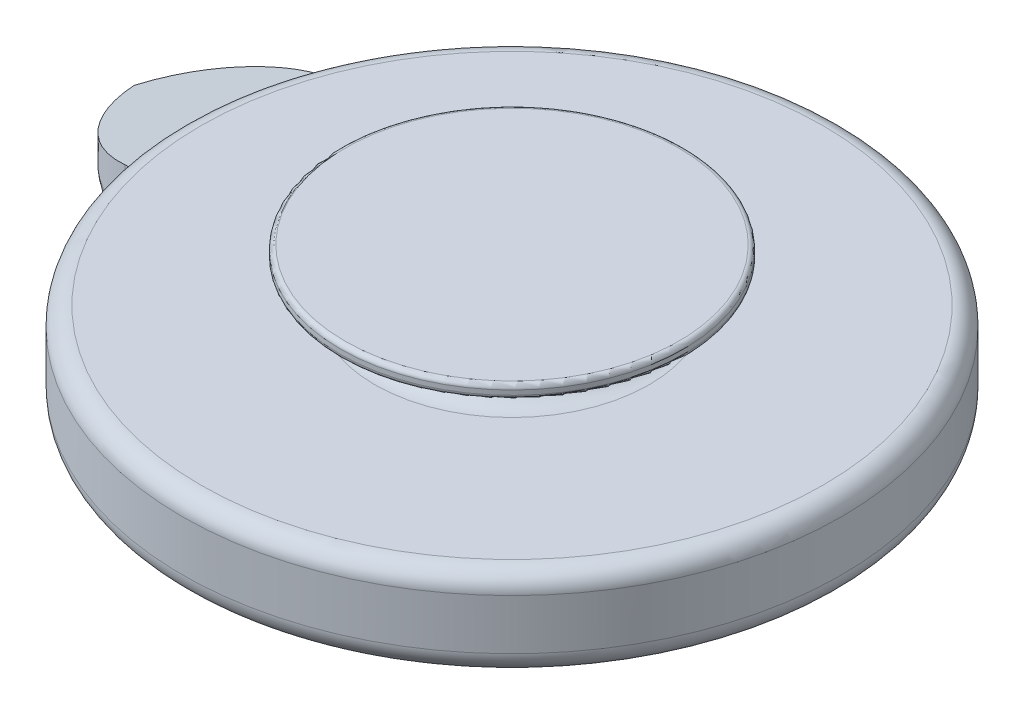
ISO-10303-21;
HEADER;
FILE_DESCRIPTION(('STEP AP214'),'2;1');
FILE_NAME('part.step','',(''),(''),'','','');
FILE_SCHEMA(('AUTOMOTIVE_DESIGN { 1 0 10303 214 1 1 1 1 }'));
ENDSEC;
DATA;
#1=APPLICATION_CONTEXT('core data for automotive mechanical design processes');
#2=APPLICATION_PROTOCOL_DEFINITION('international standard','automotive_design',2000,#1);
#3=PRODUCT_CONTEXT('',#1,'mechanical');
#4=PRODUCT('Part','Part','',(#3));
#5=PRODUCT_RELATED_PRODUCT_CATEGORY('part','',(#4));
#6=PRODUCT_DEFINITION_FORMATION('','',#4);
#7=PRODUCT_DEFINITION_CONTEXT('part definition',#1,'design');
#8=PRODUCT_DEFINITION('design','',#6,#7);
#9=PRODUCT_DEFINITION_SHAPE('','',#8);
#10=(LENGTH_UNIT() NAMED_UNIT(*) SI_UNIT(.MILLI.,.METRE.));
#11=(NAMED_UNIT(*) PLANE_ANGLE_UNIT() SI_UNIT($,.RADIAN.));
#12=(NAMED_UNIT(*) SI_UNIT($,.STERADIAN.) SOLID_ANGLE_UNIT());
#13=UNCERTAINTY_MEASURE_WITH_UNIT(LENGTH_MEASURE(1.E-05),#10,'distance_accuracy_value','');
#14=(GEOMETRIC_REPRESENTATION_CONTEXT(3) GLOBAL_UNCERTAINTY_ASSIGNED_CONTEXT((#13)) GLOBAL_UNIT_ASSIGNED_CONTEXT((#10,
#11,#12)) REPRESENTATION_CONTEXT('',''));
#15=CARTESIAN_POINT('',(0.,0.,0.));
#16=DIRECTION('',(0.,0.,1.));
#17=DIRECTION('',(1.,0.,0.));
#18=AXIS2_PLACEMENT_3D('',#15,#16,#17);
#19=CARTESIAN_POINT('',(0.,20.,0.));
#20=DIRECTION('',(0.,-1.,0.));
#21=DIRECTION('',(0.,0.,-1.));
#22=AXIS2_PLACEMENT_3D('',#19,#20,#21);
#23=CYLINDRICAL_SURFACE('',#22,72.);
#24=CARTESIAN_POINT('',(0.,16.,0.));
#25=DIRECTION('',(0.,1.,0.));
#26=DIRECTION('',(0.,0.,1.));
#27=AXIS2_PLACEMENT_3D('',#24,#25,#26);
#28=CIRCLE('',#27,72.);
#29=CARTESIAN_POINT('',(0.,16.,72.));
#30=VERTEX_POINT('',#29);
#31=EDGE_CURVE('E11',#30,#30,#28,.F.);
#32=ORIENTED_EDGE('',*,*,#31,.T.);
#33=EDGE_LOOP('',(#32));
#34=FACE_BOUND('',#33,.T.);
#35=DIRECTION('',(0.,-1.,0.));
#36=VECTOR('',#35,1.);
#37=CARTESIAN_POINT('',(-70.9536076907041,63.3112915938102,12.2305173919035));
#38=LINE('',#37,#36);
#39=CARTESIAN_POINT('',(-70.9536076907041,15.6226758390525,12.2305173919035));
#40=VERTEX_POINT('',#39);
#41=CARTESIAN_POINT('',(-70.9536076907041,5.,12.2305173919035));
#42=VERTEX_POINT('',#41);
#43=EDGE_CURVE('E248',#40,#42,#38,.T.);
#44=ORIENTED_EDGE('',*,*,#43,.T.);
#45=CARTESIAN_POINT('',(0.,5.,0.));
#46=DIRECTION('',(0.,1.,0.));
#47=DIRECTION('',(0.,0.,1.));
#48=AXIS2_PLACEMENT_3D('',#45,#46,#47);
#49=CIRCLE('',#48,72.);
#50=CARTESIAN_POINT('',(-65.9548885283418,5.,-28.878238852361));
#51=VERTEX_POINT('',#50);
#52=EDGE_CURVE('E467',#42,#51,#49,.T.);
#53=ORIENTED_EDGE('',*,*,#52,.T.);
#54=DIRECTION('',(0.,-1.,0.));
#55=VECTOR('',#54,1.);
#56=CARTESIAN_POINT('',(-65.9548885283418,63.3112915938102,-28.878238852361));
#57=LINE('',#56,#55);
#58=CARTESIAN_POINT('',(-65.9548885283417,15.5911595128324,-28.878238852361));
#59=VERTEX_POINT('',#58);
#60=EDGE_CURVE('E245',#59,#51,#57,.T.);
#61=ORIENTED_EDGE('',*,*,#60,.F.);
#62=CARTESIAN_POINT('',(0.,34.0842097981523,0.));
#63=DIRECTION('',(0.256836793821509,-0.96592582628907,0.0319712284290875));
#64=DIRECTION('',(-0.95852796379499,-0.258819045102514,-0.119318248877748));
#65=AXIS2_PLACEMENT_3D('',#62,#63,#64);
#66=ELLIPSE('',#65,74.5398849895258,72.);
#67=EDGE_CURVE('E468',#59,#40,#66,.F.);
#68=ORIENTED_EDGE('',*,*,#67,.T.);
#69=EDGE_LOOP('',(#44,#53,#61,#68));
#70=FACE_BOUND('',#69,.T.);
#71=ADVANCED_FACE('F32',(#34,#70),#23,.T.);
#72=CARTESIAN_POINT('',(0.,30.,0.));
#73=DIRECTION('',(0.,-1.,0.));
#74=DIRECTION('',(0.,0.,-1.));
#75=AXIS2_PLACEMENT_3D('',#72,#73,#74);
#76=CYLINDRICAL_SURFACE('',#75,25.);
#77=CARTESIAN_POINT('',(0.,25.,0.));
#78=DIRECTION('',(0.,1.,0.));
#79=DIRECTION('',(0.,0.,1.));
#80=AXIS2_PLACEMENT_3D('',#77,#78,#79);
#81=CIRCLE('',#80,25.);
#82=CARTESIAN_POINT('',(0.,25.,25.));
#83=VERTEX_POINT('',#82);
#84=EDGE_CURVE('E508',#83,#83,#81,.T.);
#85=ORIENTED_EDGE('',*,*,#84,.T.);
#86=EDGE_LOOP('',(#85));
#87=FACE_BOUND('',#86,.T.);
#88=CARTESIAN_POINT('',(0.,28.5,0.));
#89=DIRECTION('',(0.,1.,0.));
#90=DIRECTION('',(0.,0.,1.));
#91=AXIS2_PLACEMENT_3D('',#88,#89,#90);
#92=CIRCLE('',#91,25.);
#93=CARTESIAN_POINT('',(0.,28.5,25.));
#94=VERTEX_POINT('',#93);
#95=EDGE_CURVE('E171',#94,#94,#92,.T.);
#96=ORIENTED_EDGE('',*,*,#95,.F.);
#97=EDGE_LOOP('',(#96));
#98=FACE_BOUND('',#97,.T.);
#99=ADVANCED_FACE('F457',(#87,#98),#76,.T.);
#100=CARTESIAN_POINT('',(0.,20.,0.));
#101=DIRECTION('',(0.,1.,0.));
#102=DIRECTION('',(0.,0.,1.));
#103=AXIS2_PLACEMENT_3D('',#100,#101,#102);
#104=PLANE('',#103);
#105=CARTESIAN_POINT('',(0.,20.,0.));
#106=DIRECTION('',(0.,1.,0.));
#107=DIRECTION('',(0.,0.,1.));
#108=AXIS2_PLACEMENT_3D('',#105,#106,#107);
#109=CIRCLE('',#108,68.);
#110=CARTESIAN_POINT('',(0.,20.,68.));
#111=VERTEX_POINT('',#110);
#112=EDGE_CURVE('E40',#111,#111,#109,.T.);
#113=ORIENTED_EDGE('',*,*,#112,.T.);
#114=EDGE_LOOP('',(#113));
#115=FACE_BOUND('',#114,.T.);
#116=CARTESIAN_POINT('',(0.,20.,0.));
#117=DIRECTION('',(0.,1.,0.));
#118=DIRECTION('',(0.,0.,1.));
#119=AXIS2_PLACEMENT_3D('',#116,#117,#118);
#120=CIRCLE('',#119,30.);
#121=CARTESIAN_POINT('',(0.,20.,30.));
#122=VERTEX_POINT('',#121);
#123=EDGE_CURVE('E505',#122,#122,#120,.F.);
#124=ORIENTED_EDGE('',*,*,#123,.T.);
#125=EDGE_LOOP('',(#124));
#126=FACE_BOUND('',#125,.T.);
#127=ADVANCED_FACE('F304',(#115,#126),#104,.T.);
#128=CARTESIAN_POINT('',(0.,0.,0.));
#129=DIRECTION('',(0.,1.,0.));
#130=DIRECTION('',(0.,0.,1.));
#131=AXIS2_PLACEMENT_3D('',#128,#129,#130);
#132=PLANE('',#131);
#133=CARTESIAN_POINT('',(-68.9749573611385,0.,-34.2265285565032));
#134=DIRECTION('',(0.,1.,0.));
#135=DIRECTION('',(0.,0.,1.));
#136=AXIS2_PLACEMENT_3D('',#133,#134,#135);
#137=CIRCLE('',#136,11.);
#138=CARTESIAN_POINT('',(-67.1067134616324,0.,-23.3863410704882));
#139=VERTEX_POINT('',#138);
#140=CARTESIAN_POINT('',(-65.7395530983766,0.,-23.7131009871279));
#141=VERTEX_POINT('',#140);
#142=EDGE_CURVE('E488',#139,#141,#137,.T.);
#143=ORIENTED_EDGE('',*,*,#142,.T.);
#144=DIRECTION('',(-0.955766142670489,0.,0.294127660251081));
#145=VECTOR('',#144,1.);
#146=CARTESIAN_POINT('',(-12.3533617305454,0.,-40.1421779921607));
#147=LINE('',#146,#145);
#148=CARTESIAN_POINT('',(-62.2458191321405,0.,-24.7882633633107));
#149=VERTEX_POINT('',#148);
#150=EDGE_CURVE('E761',#141,#149,#147,.F.);
#151=ORIENTED_EDGE('',*,*,#150,.T.);
#152=CARTESIAN_POINT('',(0.,0.,0.));
#153=DIRECTION('',(0.,1.,0.));
#154=DIRECTION('',(0.,0.,1.));
#155=AXIS2_PLACEMENT_3D('',#152,#153,#154);
#156=CIRCLE('',#155,67.);
#157=CARTESIAN_POINT('',(-66.2919999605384,0.,9.71446041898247));
#158=VERTEX_POINT('',#157);
#159=EDGE_CURVE('E499',#149,#158,#156,.F.);
#160=ORIENTED_EDGE('',*,*,#159,.T.);
#161=DIRECTION('',(0.738967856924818,0.,0.673740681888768));
#162=VECTOR('',#161,1.);
#163=CARTESIAN_POINT('',(-34.9282606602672,0.,38.3097868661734));
#164=LINE('',#163,#162);
#165=CARTESIAN_POINT('',(-69.0790715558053,0.,7.1733979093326));
#166=VERTEX_POINT('',#165);
#167=EDGE_CURVE('E472',#158,#166,#164,.F.);
#168=ORIENTED_EDGE('',*,*,#167,.T.);
#169=CARTESIAN_POINT('',(-75.261041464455,0.,16.2719279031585));
#170=DIRECTION('',(0.,1.,0.));
#171=DIRECTION('',(0.,0.,1.));
#172=AXIS2_PLACEMENT_3D('',#169,#170,#171);
#173=CIRCLE('',#172,11.);
#174=CARTESIAN_POINT('',(-70.7922048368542,0.,6.22058474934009));
#175=VERTEX_POINT('',#174);
#176=EDGE_CURVE('E497',#166,#175,#173,.T.);
#177=ORIENTED_EDGE('',*,*,#176,.T.);
#178=CARTESIAN_POINT('',(-73.8457095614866,0.,5.34065634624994));
#179=CARTESIAN_POINT('',(-74.7854847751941,0.,10.2515445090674));
#180=CARTESIAN_POINT('',(-74.7854847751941,5.,10.2515445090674));
#181=CARTESIAN_POINT('',(-73.6357271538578,0.,5.38083976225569));
#182=CARTESIAN_POINT('',(-74.5755023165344,0.,10.2917279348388));
#183=CARTESIAN_POINT('',(-74.5755023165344,5.,10.2917279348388));
#184=CARTESIAN_POINT('',(-73.4257447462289,0.,5.42102317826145));
#185=CARTESIAN_POINT('',(-74.3655198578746,0.,10.3319113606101));
#186=CARTESIAN_POINT('',(-74.3655198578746,5.,10.3319113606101));
#187=CARTESIAN_POINT('',(-73.2157623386,0.,5.4612065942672));
#188=CARTESIAN_POINT('',(-74.1555373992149,0.,10.3720947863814));
#189=CARTESIAN_POINT('',(-74.1555373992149,5.,10.3720947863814));
#190=CARTESIAN_POINT('',(-73.0056618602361,0.,5.50141725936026));
#191=CARTESIAN_POINT('',(-74.0405598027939,0.,10.3940841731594));
#192=CARTESIAN_POINT('',(-74.0405598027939,5.,10.3940841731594));
#193=CARTESIAN_POINT('',(-72.796731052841,0.,5.5477228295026));
#194=CARTESIAN_POINT('',(-73.9257565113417,0.,10.4195298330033));
#195=CARTESIAN_POINT('',(-73.9257565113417,5.,10.4195298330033));
#196=CARTESIAN_POINT('',(-72.3818873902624,0.,5.65230337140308));
#197=CARTESIAN_POINT('',(-73.697396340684,0.,10.4771066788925));
#198=CARTESIAN_POINT('',(-73.697396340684,5.,10.4771066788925));
#199=CARTESIAN_POINT('',(-72.1759745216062,0.,5.71057828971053));
#200=CARTESIAN_POINT('',(-73.5838394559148,0.,10.5092378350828));
#201=CARTESIAN_POINT('',(-73.5838394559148,5.,10.5092378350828));
#202=CARTESIAN_POINT('',(-71.7713234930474,0.,5.83778350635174));
#203=CARTESIAN_POINT('',(-73.3607871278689,0.,10.5793558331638));
#204=CARTESIAN_POINT('',(-73.3607871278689,5.,10.5793558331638));
#205=CARTESIAN_POINT('',(-71.5725228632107,0.,5.90651514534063));
#206=CARTESIAN_POINT('',(-73.2512554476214,0.,10.6172334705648));
#207=CARTESIAN_POINT('',(-73.2512554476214,5.,10.6172334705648));
#208=CARTESIAN_POINT('',(-71.1790679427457,0.,6.05518728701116));
#209=CARTESIAN_POINT('',(-73.0350305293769,0.,10.69892939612));
#210=CARTESIAN_POINT('',(-73.0350305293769,5.,10.69892939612));
#211=CARTESIAN_POINT('',(-70.9844153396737,0.,6.13513225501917));
#212=CARTESIAN_POINT('',(-72.9283384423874,0.,10.7427500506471));
#213=CARTESIAN_POINT('',(-72.9283384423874,5.,10.7427500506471));
#214=CARTESIAN_POINT('',(-70.7922048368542,0.,6.22058474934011));
#215=CARTESIAN_POINT('',(-72.8234942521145,0.,10.7893770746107));
#216=CARTESIAN_POINT('',(-72.8234942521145,5.,10.7893770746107));
#217=CARTESIAN_POINT('',(-70.5968499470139,0.,6.30743971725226));
#218=CARTESIAN_POINT('',(-72.6281393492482,0.,10.8762320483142));
#219=CARTESIAN_POINT('',(-72.6281393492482,5.,10.8762320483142));
#220=CARTESIAN_POINT('',(-70.4014950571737,0.,6.39429468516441));
#221=CARTESIAN_POINT('',(-72.432784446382,0.,10.9630870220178));
#222=CARTESIAN_POINT('',(-72.432784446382,5.,10.9630870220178));
#223=CARTESIAN_POINT('',(-70.2061401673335,0.,6.48114965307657));
#224=CARTESIAN_POINT('',(-72.2374295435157,0.,11.0499419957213));
#225=CARTESIAN_POINT('',(-72.2374295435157,5.,11.0499419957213));
#226=(BOUNDED_SURFACE() B_SPLINE_SURFACE(3,2,((#178,#179,#180),(#181,#182,#183),(#184,#185,
#186),(#187,#188,#189),(#190,#191,#192),(#193,#194,#195),(#196,#197,#198),(#199,#200,#201),
(#202,#203,#204),(#205,#206,#207),(#208,#209,#210),(#211,#212,#213),(#214,#215,#216),(#217,#218,
#219),(#220,#221,#222),(#223,#224,#225)),.UNSPECIFIED.,.F.,.F.,
.F.) B_SPLINE_SURFACE_WITH_KNOTS((4,3,2,2,2,3,4),(3,3),(0.,0.641378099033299,1.28302548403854,
1.92467000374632,2.55537222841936,3.18632632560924,3.82770442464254),(0.,1.),
.UNSPECIFIED.) GEOMETRIC_REPRESENTATION_ITEM() RATIONAL_B_SPLINE_SURFACE(((1.,0.707106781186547,
1.),(1.,0.707106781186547,1.),(1.,0.707106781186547,1.),(1.,0.707106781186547,1.),(1.,
0.707106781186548,1.),(1.,0.707106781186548,1.),(1.,0.707106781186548,1.),(1.,0.707106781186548,
1.),(1.,0.707106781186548,1.),(1.,0.707106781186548,1.),(1.,0.707106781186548,1.),(1.,
0.707106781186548,1.),(1.,0.707106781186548,1.),(1.,0.707106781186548,1.),(1.,0.707106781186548,
1.),(1.,0.707106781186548,1.))) REPRESENTATION_ITEM('') SURFACE());
#227=CARTESIAN_POINT('',(-70.2061401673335,0.,6.48114965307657));
#228=CARTESIAN_POINT('',(-70.4014950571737,0.,6.39429468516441));
#229=CARTESIAN_POINT('',(-70.5968499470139,0.,6.30743971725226));
#230=CARTESIAN_POINT('',(-70.7922048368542,0.,6.22058474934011));
#231=CARTESIAN_POINT('',(-70.9844153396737,0.,6.13513225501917));
#232=CARTESIAN_POINT('',(-71.1790679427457,0.,6.05518728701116));
#233=CARTESIAN_POINT('',(-71.5725228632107,0.,5.90651514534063));
#234=CARTESIAN_POINT('',(-71.7713234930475,0.,5.83778350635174));
#235=CARTESIAN_POINT('',(-72.1759745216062,0.,5.71057828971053));
#236=CARTESIAN_POINT('',(-72.3818873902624,0.,5.65230337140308));
#237=CARTESIAN_POINT('',(-72.796731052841,0.,5.5477228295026));
#238=CARTESIAN_POINT('',(-73.0056618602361,0.,5.50141725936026));
#239=CARTESIAN_POINT('',(-73.2157623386,0.,5.4612065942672));
#240=CARTESIAN_POINT('',(-73.4257447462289,0.,5.42102317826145));
#241=CARTESIAN_POINT('',(-73.6357271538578,0.,5.38083976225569));
#242=CARTESIAN_POINT('',(-73.8457095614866,0.,5.34065634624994));
#243=B_SPLINE_CURVE_WITH_KNOTS('',3,(#227,#228,#229,#230,#231,#232,#233,#234,#235,#236,#237,
#238,#239,#240,#241,#242),.UNSPECIFIED.,.F.,.F.,(4,3,2,2,2,3,4),(0.,0.64137809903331,
1.27233219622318,1.90303442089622,2.544678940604,3.18632632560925,3.82770442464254),.UNSPECIFIED.);
#244=CARTESIAN_POINT('',(-73.2157623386,0.,5.46120659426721));
#245=VERTEX_POINT('',#244);
#246=EDGE_CURVE('E332',#175,#245,#243,.T.);
#247=ORIENTED_EDGE('',*,*,#246,.T.);
#248=CARTESIAN_POINT('',(-62.1992866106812,5.,12.6601102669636));
#249=CARTESIAN_POINT('',(-62.1992866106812,0.,12.6601102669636));
#250=CARTESIAN_POINT('',(-61.2595113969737,0.,7.74922210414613));
#251=CARTESIAN_POINT('',(-66.1847036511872,5.,11.8974384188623));
#252=CARTESIAN_POINT('',(-66.1847036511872,0.,11.8974384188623));
#253=CARTESIAN_POINT('',(-65.2449283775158,0.,6.98655026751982));
#254=CARTESIAN_POINT('',(-70.1701206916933,5.,11.1347665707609));
#255=CARTESIAN_POINT('',(-70.1701206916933,0.,11.1347665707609));
#256=CARTESIAN_POINT('',(-69.2303453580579,0.,6.2238784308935));
#257=CARTESIAN_POINT('',(-74.1555377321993,5.,10.3720947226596));
#258=CARTESIAN_POINT('',(-74.1555377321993,0.,10.3720947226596));
#259=CARTESIAN_POINT('',(-73.2157623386,0.,5.46120659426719));
#260=CARTESIAN_POINT('',(-74.4964562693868,5.,10.3068439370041));
#261=CARTESIAN_POINT('',(-74.4964562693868,0.,10.3068439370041));
#262=CARTESIAN_POINT('',(-73.4853440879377,0.,5.40961204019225));
#263=CARTESIAN_POINT('',(-74.8354349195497,5.,10.234284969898));
#264=CARTESIAN_POINT('',(-74.8354349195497,0.,10.234284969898));
#265=CARTESIAN_POINT('',(-73.7537527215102,0.,5.35216387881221));
#266=CARTESIAN_POINT('',(-75.5092243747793,5.,10.0748254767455));
#267=CARTESIAN_POINT('',(-75.5092243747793,0.,10.0748254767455));
#268=CARTESIAN_POINT('',(-74.2878381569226,0.,5.22576596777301));
#269=CARTESIAN_POINT('',(-75.8440353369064,5.,9.98792549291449));
#270=CARTESIAN_POINT('',(-75.8440353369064,0.,9.98792549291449));
#271=CARTESIAN_POINT('',(-74.5535150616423,0.,5.1568166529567));
#272=CARTESIAN_POINT('',(-76.841655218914,5.,9.70616535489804));
#273=CARTESIAN_POINT('',(-76.841655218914,0.,9.70616535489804));
#274=CARTESIAN_POINT('',(-75.3457669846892,0.,4.93305651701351));
#275=CARTESIAN_POINT('',(-77.4978234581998,5.,9.4902118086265));
#276=CARTESIAN_POINT('',(-77.4978234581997,0.,9.49021180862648));
#277=CARTESIAN_POINT('',(-75.8676996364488,0.,4.76130726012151));
#278=CARTESIAN_POINT('',(-78.4652829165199,5.,9.12593650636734));
#279=CARTESIAN_POINT('',(-78.4652829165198,0.,9.12593650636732));
#280=CARTESIAN_POINT('',(-76.6376278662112,0.,4.47141114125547));
#281=CARTESIAN_POINT('',(-78.7847033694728,5.,8.99791449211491));
#282=CARTESIAN_POINT('',(-78.7847033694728,0.,8.9979144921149));
#283=CARTESIAN_POINT('',(-76.8918959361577,0.,4.36950175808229));
#284=CARTESIAN_POINT('',(-79.4179079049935,5.,8.72852779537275));
#285=CARTESIAN_POINT('',(-79.4179079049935,0.,8.72852779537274));
#286=CARTESIAN_POINT('',(-77.3959395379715,0.,4.155064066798));
#287=CARTESIAN_POINT('',(-79.7316920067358,5.,8.58716315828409));
#288=CARTESIAN_POINT('',(-79.7316920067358,0.,8.58716315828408));
#289=CARTESIAN_POINT('',(-77.6457150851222,0.,4.04253579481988));
#290=CARTESIAN_POINT('',(-80.3531687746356,5.,8.29126279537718));
#291=CARTESIAN_POINT('',(-80.3531687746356,0.,8.29126279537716));
#292=CARTESIAN_POINT('',(-78.1402943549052,0.,3.80705429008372));
#293=CARTESIAN_POINT('',(-80.6608616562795,5.,8.1367275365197));
#294=CARTESIAN_POINT('',(-80.6608616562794,0.,8.13672753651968));
#295=CARTESIAN_POINT('',(-78.3850982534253,0.,3.6841014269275));
#296=CARTESIAN_POINT('',(-81.117532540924,5.,7.89513487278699));
#297=CARTESIAN_POINT('',(-81.117532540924,0.,7.89513487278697));
#298=CARTESIAN_POINT('',(-78.7482253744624,0.,3.49199649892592));
#299=CARTESIAN_POINT('',(-81.2689485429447,5.,7.81297014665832));
#300=CARTESIAN_POINT('',(-81.2689485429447,0.,7.8129701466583));
#301=CARTESIAN_POINT('',(-78.8685909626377,0.,3.42668049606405));
#302=CARTESIAN_POINT('',(-81.5700483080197,5.,7.64541668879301));
#303=CARTESIAN_POINT('',(-81.5700483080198,0.,7.645416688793));
#304=CARTESIAN_POINT('',(-79.1079082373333,0.,3.29350763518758));
#305=CARTESIAN_POINT('',(-81.7197320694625,5.,7.56002795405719));
#306=CARTESIAN_POINT('',(-81.7197320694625,0.,7.56002795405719));
#307=CARTESIAN_POINT('',(-79.2268599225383,0.,3.22565077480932));
#308=CARTESIAN_POINT('',(-82.1657020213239,5.,7.29933310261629));
#309=CARTESIAN_POINT('',(-82.1657020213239,0.,7.2993331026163));
#310=CARTESIAN_POINT('',(-79.581495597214,0.,3.01834437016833));
#311=CARTESIAN_POINT('',(-82.4589546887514,5.,7.11947303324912));
#312=CARTESIAN_POINT('',(-82.4589546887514,0.,7.11947303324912));
#313=CARTESIAN_POINT('',(-79.8149981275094,0.,2.87513893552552));
#314=CARTESIAN_POINT('',(-83.0371770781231,5.,6.74797408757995));
#315=CARTESIAN_POINT('',(-83.0371770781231,0.,6.74797408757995));
#316=CARTESIAN_POINT('',(-80.2757968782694,0.,2.57908439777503));
#317=CARTESIAN_POINT('',(-83.3221467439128,5.,6.55633513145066));
#318=CARTESIAN_POINT('',(-83.3221467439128,0.,6.55633513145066));
#319=CARTESIAN_POINT('',(-80.5030930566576,0.,2.42623522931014));
#320=CARTESIAN_POINT('',(-83.8834751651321,5.,6.16169249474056));
#321=CARTESIAN_POINT('',(-83.8834751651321,0.,6.16169249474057));
#322=CARTESIAN_POINT('',(-80.9511544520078,0.,2.11122441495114));
#323=CARTESIAN_POINT('',(-84.1598335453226,5.,5.95868831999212));
#324=CARTESIAN_POINT('',(-84.1598335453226,0.,5.95868831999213));
#325=CARTESIAN_POINT('',(-81.1719193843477,0.,1.94906236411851));
#326=CARTESIAN_POINT('',(-84.7036357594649,5.,5.54170074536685));
#327=CARTESIAN_POINT('',(-84.7036357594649,0.,5.54170074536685));
#328=CARTESIAN_POINT('',(-81.6065710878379,0.,1.61577173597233));
#329=CARTESIAN_POINT('',(-84.9710796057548,5.,5.32771736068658));
#330=CARTESIAN_POINT('',(-84.9710796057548,0.,5.32771736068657));
#331=CARTESIAN_POINT('',(-81.8204578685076,0.,1.44464317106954));
#332=CARTESIAN_POINT('',(-85.496765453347,5.,4.88912393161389));
#333=CARTESIAN_POINT('',(-85.496765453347,0.,4.88912393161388));
#334=CARTESIAN_POINT('',(-82.241039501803,0.,1.09374064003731));
#335=CARTESIAN_POINT('',(-85.7550069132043,5.,4.66451326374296));
#336=CARTESIAN_POINT('',(-85.7550069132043,0.,4.66451326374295));
#337=CARTESIAN_POINT('',(-82.4477339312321,0.,0.913966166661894));
#338=CARTESIAN_POINT('',(-86.2619714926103,5.,4.20501858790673));
#339=CARTESIAN_POINT('',(-86.2619714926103,0.,4.20501858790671));
#340=CARTESIAN_POINT('',(-82.8535911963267,0.,0.546112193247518));
#341=CARTESIAN_POINT('',(-86.5106946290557,5.,3.97013459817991));
#342=CARTESIAN_POINT('',(-86.5106946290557,0.,3.97013459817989));
#343=CARTESIAN_POINT('',(-83.0527540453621,0.,0.358032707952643));
#344=CARTESIAN_POINT('',(-86.9982816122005,5.,3.49046121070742));
#345=CARTESIAN_POINT('',(-86.9982816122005,0.,3.49046121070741));
#346=CARTESIAN_POINT('',(-83.4432262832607,0.,-0.0261035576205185));
#347=CARTESIAN_POINT('',(-87.2371458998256,5.,3.24567225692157));
#348=CARTESIAN_POINT('',(-87.2371458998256,0.,3.24567225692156));
#349=CARTESIAN_POINT('',(-83.634536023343,0.,-0.222159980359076));
#350=CARTESIAN_POINT('',(-87.5878633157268,5.,2.87123558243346));
#351=CARTESIAN_POINT('',(-87.5878633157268,0.,2.87123558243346));
#352=CARTESIAN_POINT('',(-83.9153581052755,0.,-0.521972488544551));
#353=CARTESIAN_POINT('',(-87.7035078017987,5.,2.74521233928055));
#354=CARTESIAN_POINT('',(-87.7035078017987,0.,2.74521233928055));
#355=CARTESIAN_POINT('',(-84.0079431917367,0.,-0.622866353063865));
#356=CARTESIAN_POINT('',(-87.9320604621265,5.,2.49098934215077));
#357=CARTESIAN_POINT('',(-87.9320604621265,0.,2.49098934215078));
#358=CARTESIAN_POINT('',(-84.1910379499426,0.,-0.82652632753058));
#359=CARTESIAN_POINT('',(-88.0449685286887,5.,2.36278950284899));
#360=CARTESIAN_POINT('',(-88.0449685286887,0.,2.362789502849));
#361=CARTESIAN_POINT('',(-84.2815475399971,0.,-0.929292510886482));
#362=CARTESIAN_POINT('',(-88.3841567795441,5.,1.96970937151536));
#363=CARTESIAN_POINT('',(-88.3841567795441,0.,1.96970937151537));
#364=CARTESIAN_POINT('',(-84.5536196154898,0.,-1.24459285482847));
#365=CARTESIAN_POINT('',(-88.6060770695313,5.,1.70149807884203));
#366=CARTESIAN_POINT('',(-88.6060770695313,0.,1.70149807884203));
#367=CARTESIAN_POINT('',(-84.7318654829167,0.,-1.46000922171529));
#368=CARTESIAN_POINT('',(-89.0383304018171,5.,1.15681732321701));
#369=CARTESIAN_POINT('',(-89.0383304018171,0.,1.15681732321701));
#370=CARTESIAN_POINT('',(-85.0794056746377,0.,-1.89794238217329));
#371=CARTESIAN_POINT('',(-89.2486621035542,5.,0.880346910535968));
#372=CARTESIAN_POINT('',(-89.2486621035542,0.,0.880346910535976));
#373=CARTESIAN_POINT('',(-85.2486989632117,0.,-2.1204599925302));
#374=CARTESIAN_POINT('',(-89.8621510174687,5.,0.0391694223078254));
#375=CARTESIAN_POINT('',(-89.8621510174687,0.,0.0391694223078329));
#376=CARTESIAN_POINT('',(-85.7428792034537,0.,-2.7980536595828));
#377=CARTESIAN_POINT('',(-90.2478789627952,5.,-0.537393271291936));
#378=CARTESIAN_POINT('',(-90.2478789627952,0.,-0.537393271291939));
#379=CARTESIAN_POINT('',(-86.0541283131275,0.,-3.26324228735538));
#380=CARTESIAN_POINT('',(-90.790596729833,5.,-1.42318440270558));
#381=CARTESIAN_POINT('',(-90.790596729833,0.,-1.42318440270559));
#382=CARTESIAN_POINT('',(-86.4923398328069,0.,-3.97845895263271));
#383=CARTESIAN_POINT('',(-90.9655715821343,5.,-1.72203377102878));
#384=CARTESIAN_POINT('',(-90.9655715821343,0.,-1.72203377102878));
#385=CARTESIAN_POINT('',(-86.6336720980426,0.,-4.21984651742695));
#386=CARTESIAN_POINT('',(-91.3034257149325,5.,-2.32640761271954));
#387=CARTESIAN_POINT('',(-91.3034257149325,0.,-2.32640761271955));
#388=CARTESIAN_POINT('',(-86.9066059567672,0.,-4.70808873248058));
#389=CARTESIAN_POINT('',(-91.4663049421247,5.,-2.63193211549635));
#390=CARTESIAN_POINT('',(-91.4663049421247,0.,-2.63193211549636));
#391=CARTESIAN_POINT('',(-87.0382075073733,0.,-4.95494340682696));
#392=CARTESIAN_POINT('',(-91.7797671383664,5.,-3.24927610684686));
#393=CARTESIAN_POINT('',(-91.7797671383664,0.,-3.24927610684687));
#394=CARTESIAN_POINT('',(-87.2914424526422,0.,-5.45367208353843));
#395=CARTESIAN_POINT('',(-91.9303517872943,5.,-3.5610947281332));
#396=CARTESIAN_POINT('',(-91.9303517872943,0.,-3.56109472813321));
#397=CARTESIAN_POINT('',(-87.4130772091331,0.,-5.70554539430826));
#398=CARTESIAN_POINT('',(-92.1467998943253,5.,-4.03317110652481));
#399=CARTESIAN_POINT('',(-92.1467998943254,0.,-4.03317110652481));
#400=CARTESIAN_POINT('',(-87.5878993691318,0.,-6.08683415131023));
#401=CARTESIAN_POINT('',(-92.2173779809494,5.,-4.19125511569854));
#402=CARTESIAN_POINT('',(-92.2173779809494,0.,-4.19125511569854));
#403=CARTESIAN_POINT('',(-87.6449019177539,0.,-6.21451058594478));
#404=CARTESIAN_POINT('',(-92.3553052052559,5.,-4.50864306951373));
#405=CARTESIAN_POINT('',(-92.3553052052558,0.,-4.50864306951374));
#406=CARTESIAN_POINT('',(-87.7563530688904,0.,-6.47097473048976));
#407=CARTESIAN_POINT('',(-92.4226542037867,5.,-4.66794706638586));
#408=CARTESIAN_POINT('',(-92.4226542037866,0.,-4.66794706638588));
#409=CARTESIAN_POINT('',(-87.8108015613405,0.,-6.5997624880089));
#410=CARTESIAN_POINT('',(-92.7162495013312,5.,-5.3820783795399));
#411=CARTESIAN_POINT('',(-92.7162495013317,0.,-5.38207837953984));
#412=CARTESIAN_POINT('',(-88.0482359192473,0.,-7.17728922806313));
#413=CARTESIAN_POINT('',(-92.92484083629,5.,-5.94365799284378));
#414=CARTESIAN_POINT('',(-92.9248408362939,0.,-5.94365799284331));
#415=CARTESIAN_POINT('',(-88.2171369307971,0.,-7.63196603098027));
#416=CARTESIAN_POINT('',(-93.2084694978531,5.,-6.79480183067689));
#417=CARTESIAN_POINT('',(-93.2084694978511,0.,-6.79480183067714));
#418=CARTESIAN_POINT('',(-88.4469623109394,0.,-8.32165272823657));
#419=CARTESIAN_POINT('',(-93.2981402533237,5.,-7.07999528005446));
#420=CARTESIAN_POINT('',(-93.2981402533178,0.,-7.07999528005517));
#421=CARTESIAN_POINT('',(-88.5196532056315,0.,-8.55284021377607));
#422=CARTESIAN_POINT('',(-93.467707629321,5.,-7.6530990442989));
#423=CARTESIAN_POINT('',(-93.4677076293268,0.,-7.6530990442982));
#424=CARTESIAN_POINT('',(-88.6571518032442,0.,-9.01755155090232));
#425=CARTESIAN_POINT('',(-93.5476042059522,5.,-7.94100937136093));
#426=CARTESIAN_POINT('',(-93.5476042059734,0.,-7.94100937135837));
#427=CARTESIAN_POINT('',(-88.7219594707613,0.,-9.25107541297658));
#428=CARTESIAN_POINT('',(-93.7722522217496,5.,-8.80677932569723));
#429=CARTESIAN_POINT('',(-93.772252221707,0.,-8.80677932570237));
#430=CARTESIAN_POINT('',(-88.9043296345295,0.,-9.95393816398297));
#431=CARTESIAN_POINT('',(-93.9023066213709,5.,-9.38771515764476));
#432=CARTESIAN_POINT('',(-93.9023066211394,0.,-9.3877151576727));
#433=CARTESIAN_POINT('',(-89.0101183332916,0.,-10.4264071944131));
#434=CARTESIAN_POINT('',(-94.0681976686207,5.,-10.2645656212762));
#435=CARTESIAN_POINT('',(-94.0681976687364,0.,-10.2645656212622));
#436=CARTESIAN_POINT('',(-89.1450276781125,0.,-11.1394742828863));
#437=CARTESIAN_POINT('',(-94.1186311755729,5.,-10.5577699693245));
#438=CARTESIAN_POINT('',(-94.1186311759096,0.,-10.5577699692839));
#439=CARTESIAN_POINT('',(-89.1860364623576,0.,-11.3779011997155));
#440=CARTESIAN_POINT('',(-94.2097032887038,5.,-11.1459561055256));
#441=CARTESIAN_POINT('',(-94.2097032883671,0.,-11.1459561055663));
#442=CARTESIAN_POINT('',(-89.2600618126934,0.,-11.8559908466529));
#443=CARTESIAN_POINT('',(-94.2503419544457,5.,-11.4409378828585));
#444=CARTESIAN_POINT('',(-94.2503419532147,0.,-11.4409378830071));
#445=CARTESIAN_POINT('',(-89.2930784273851,0.,-12.0956535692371));
#446=CARTESIAN_POINT('',(-94.2860528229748,5.,-11.7367952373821));
#447=CARTESIAN_POINT('',(-94.2860528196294,0.,-11.7367952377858));
#448=CARTESIAN_POINT('',(-89.3220667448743,0.,-12.335829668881));
#449=CARTESIAN_POINT('',(-94.38741034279,5.,-12.5767123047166));
#450=CARTESIAN_POINT('',(-94.38741034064,0.,-12.5767123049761));
#451=CARTESIAN_POINT('',(-89.423424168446,0.,-13.1757459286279));
#452=CARTESIAN_POINT('',(-94.4887678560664,5.,-13.416629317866));
#453=CARTESIAN_POINT('',(-94.4887678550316,0.,-13.4166293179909));
#454=CARTESIAN_POINT('',(-89.5247815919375,0.,-14.0156621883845));
#455=CARTESIAN_POINT('',(-95.8977944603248,5.,-25.0927782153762));
#456=CARTESIAN_POINT('',(-95.8977944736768,0.,-25.092778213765));
#457=CARTESIAN_POINT('',(-90.9338070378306,0.,-25.6918013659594));
#458=CARTESIAN_POINT('',(-97.2054624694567,5.,-35.9290011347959));
#459=CARTESIAN_POINT('',(-97.2054624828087,0.,-35.9290011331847));
#460=CARTESIAN_POINT('',(-92.2414750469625,0.,-36.5280242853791));
#461=CARTESIAN_POINT('',(-98.5131293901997,5.,-46.7652150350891));
#462=CARTESIAN_POINT('',(-98.5131293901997,0.,-46.7652150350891));
#463=CARTESIAN_POINT('',(-93.5491430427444,0.,-47.3642472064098));
#464=(BOUNDED_SURFACE() B_SPLINE_SURFACE(3,2,((#248,#249,#250),(#251,#252,#253),(#254,#255,
#256),(#257,#258,#259),(#260,#261,#262),(#263,#264,#265),(#266,#267,#268),(#269,#270,#271),
(#272,#273,#274),(#275,#276,#277),(#278,#279,#280),(#281,#282,#283),(#284,#285,#286),(#287,#288,
#289),(#290,#291,#292),(#293,#294,#295),(#296,#297,#298),(#299,#300,#301),(#302,#303,#304),
(#305,#306,#307),(#308,#309,#310),(#311,#312,#313),(#314,#315,#316),(#317,#318,#319),(#320,#321,
#322),(#323,#324,#325),(#326,#327,#328),(#329,#330,#331),(#332,#333,#334),(#335,#336,#337),
(#338,#339,#340),(#341,#342,#343),(#344,#345,#346),(#347,#348,#349),(#350,#351,#352),(#353,#354,
#355),(#356,#357,#358),(#359,#360,#361),(#362,#363,#364),(#365,#366,#367),(#368,#369,#370),
(#371,#372,#373),(#374,#375,#376),(#377,#378,#379),(#380,#381,#382),(#383,#384,#385),(#386,#387,
#388),(#389,#390,#391),(#392,#393,#394),(#395,#396,#397),(#398,#399,#400),(#401,#402,#403),
(#404,#405,#406),(#407,#408,#409),(#410,#411,#412),(#413,#414,#415),(#416,#417,#418),(#419,#420,
#421),(#422,#423,#424),(#425,#426,#427),(#428,#429,#430),(#431,#432,#433),(#434,#435,#436),
(#437,#438,#439),(#440,#441,#442),(#443,#444,#445),(#446,#447,#448),(#449,#450,#451),(#452,#453,
#454),(#455,#456,#457),(#458,#459,#460),(#461,#462,#463)),.UNSPECIFIED.,.F.,.F.,
.F.) B_SPLINE_SURFACE_WITH_KNOTS((4,3,2,2,2,2,2,2,2,2,2,2,2,2,2,2,2,2,2,2,2,2,2,2,2,2,2,2,2,2,2,
2,3,2,4),(3,3),(0.,12.1732062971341,12.9964644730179,13.8196915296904,15.4657301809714,
16.2873390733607,17.1089451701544,17.9305221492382,18.3413314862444,18.7521412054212,
19.5736320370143,20.3951284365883,21.2166605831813,22.0381915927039,22.8597708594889,
23.6813486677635,24.5028896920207,24.9136737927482,25.3244740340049,26.1629981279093,
27.0016190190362,28.6785775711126,29.5175694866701,30.3565650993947,31.1954458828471,
31.6148887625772,32.0343497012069,33.4880462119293,34.2149769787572,34.9419110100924,
36.3931318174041,37.1188063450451,37.8444764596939,40.3825059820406,73.1270246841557),(0.,1.),
.UNSPECIFIED.) GEOMETRIC_REPRESENTATION_ITEM() RATIONAL_B_SPLINE_SURFACE(((1.,0.707106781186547,
1.),(1.,0.707106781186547,1.),(1.,0.707106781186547,1.),(1.,0.707106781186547,1.),(1.,
0.707106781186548,1.),(1.,0.707106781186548,1.),(1.,0.707106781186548,1.),(1.,0.707106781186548,
1.),(1.,0.707106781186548,1.),(1.,0.707106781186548,1.),(1.,0.707106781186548,1.),(1.,
0.707106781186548,1.),(1.,0.707106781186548,1.),(1.,0.707106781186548,1.),(1.,0.707106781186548,
1.),(1.,0.707106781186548,1.),(1.,0.707106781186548,1.),(1.,0.707106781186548,1.),(1.,
0.707106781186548,1.),(1.,0.707106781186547,1.),(1.,0.707106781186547,1.),(1.,0.707106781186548,
1.),(1.,0.707106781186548,1.),(1.,0.707106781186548,1.),(1.,0.707106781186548,1.),(1.,
0.707106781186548,1.),(1.,0.707106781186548,1.),(1.,0.707106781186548,1.),(1.,0.707106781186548,
1.),(1.,0.707106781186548,1.),(1.,0.707106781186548,1.),(1.,0.707106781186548,1.),(1.,
0.707106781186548,1.),(1.,0.707106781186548,1.),(1.,0.707106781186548,1.),(1.,0.707106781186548,
1.),(1.,0.707106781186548,1.),(1.,0.707106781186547,1.),(1.,0.707106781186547,1.),(1.,
0.707106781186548,1.),(1.,0.707106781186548,1.),(1.,0.707106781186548,1.),(1.,0.707106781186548,
1.),(1.,0.707106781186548,1.),(1.,0.707106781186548,1.),(1.,0.707106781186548,1.),(1.,
0.707106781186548,1.),(1.,0.707106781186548,1.),(1.,0.707106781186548,1.),(1.,0.707106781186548,
1.),(1.,0.707106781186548,1.),(1.,0.707106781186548,1.),(1.,0.707106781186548,1.),(1.,
0.707106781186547,1.),(1.,0.707106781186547,1.),(1.,0.707106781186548,1.),(1.,0.707106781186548,
1.),(1.,0.707106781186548,1.),(1.,0.707106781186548,1.),(1.,0.707106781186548,1.),(1.,
0.707106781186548,1.),(1.,0.707106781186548,1.),(1.,0.707106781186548,1.),(1.,0.707106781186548,
1.),(1.,0.707106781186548,1.),(1.,0.707106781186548,1.),(1.,0.707106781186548,1.),(1.,
0.707106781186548,1.),(1.,0.707106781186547,1.),(1.,0.707106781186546,1.),(1.,0.707106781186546,
1.),(1.,0.707106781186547,1.))) REPRESENTATION_ITEM('') SURFACE());
#465=CARTESIAN_POINT('',(-61.2595113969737,0.,7.74922210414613));
#466=CARTESIAN_POINT('',(-65.2449283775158,0.,6.98655026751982));
#467=CARTESIAN_POINT('',(-69.2303453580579,0.,6.2238784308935));
#468=CARTESIAN_POINT('',(-73.2157623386,0.,5.46120659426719));
#469=CARTESIAN_POINT('',(-73.4853440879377,0.,5.40961204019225));
#470=CARTESIAN_POINT('',(-73.7537527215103,0.,5.35216387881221));
#471=CARTESIAN_POINT('',(-74.2878381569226,0.,5.22576596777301));
#472=CARTESIAN_POINT('',(-74.5535150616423,0.,5.1568166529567));
#473=CARTESIAN_POINT('',(-75.3457669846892,0.,4.93305651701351));
#474=CARTESIAN_POINT('',(-75.8676996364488,0.,4.76130726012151));
#475=CARTESIAN_POINT('',(-76.6376278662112,0.,4.47141114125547));
#476=CARTESIAN_POINT('',(-76.8918959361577,0.,4.36950175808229));
#477=CARTESIAN_POINT('',(-77.3959395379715,0.,4.155064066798));
#478=CARTESIAN_POINT('',(-77.6457150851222,0.,4.04253579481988));
#479=CARTESIAN_POINT('',(-78.1402943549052,0.,3.80705429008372));
#480=CARTESIAN_POINT('',(-78.3850982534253,0.,3.6841014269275));
#481=CARTESIAN_POINT('',(-78.7482253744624,0.,3.49199649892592));
#482=CARTESIAN_POINT('',(-78.8685909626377,0.,3.42668049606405));
#483=CARTESIAN_POINT('',(-79.1079082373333,0.,3.29350763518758));
#484=CARTESIAN_POINT('',(-79.2268599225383,0.,3.22565077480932));
#485=CARTESIAN_POINT('',(-79.581495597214,0.,3.01834437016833));
#486=CARTESIAN_POINT('',(-79.8149981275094,0.,2.87513893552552));
#487=CARTESIAN_POINT('',(-80.2757968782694,0.,2.57908439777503));
#488=CARTESIAN_POINT('',(-80.5030930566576,0.,2.42623522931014));
#489=CARTESIAN_POINT('',(-80.9511544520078,0.,2.11122441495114));
#490=CARTESIAN_POINT('',(-81.1719193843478,0.,1.94906236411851));
#491=CARTESIAN_POINT('',(-81.6065710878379,0.,1.61577173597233));
#492=CARTESIAN_POINT('',(-81.8204578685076,0.,1.44464317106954));
#493=CARTESIAN_POINT('',(-82.241039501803,0.,1.09374064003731));
#494=CARTESIAN_POINT('',(-82.4477339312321,0.,0.913966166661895));
#495=CARTESIAN_POINT('',(-82.8535911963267,0.,0.546112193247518));
#496=CARTESIAN_POINT('',(-83.0527540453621,0.,0.358032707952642));
#497=CARTESIAN_POINT('',(-83.4432262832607,0.,-0.0261035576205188));
#498=CARTESIAN_POINT('',(-83.634536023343,0.,-0.222159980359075));
#499=CARTESIAN_POINT('',(-83.9153581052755,0.,-0.521972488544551));
#500=CARTESIAN_POINT('',(-84.0079431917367,0.,-0.622866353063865));
#501=CARTESIAN_POINT('',(-84.1910379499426,0.,-0.82652632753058));
#502=CARTESIAN_POINT('',(-84.2815475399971,0.,-0.929292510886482));
#503=CARTESIAN_POINT('',(-84.5536196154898,0.,-1.24459285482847));
#504=CARTESIAN_POINT('',(-84.7318654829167,0.,-1.46000922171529));
#505=CARTESIAN_POINT('',(-85.0794056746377,0.,-1.89794238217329));
#506=CARTESIAN_POINT('',(-85.2486989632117,0.,-2.1204599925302));
#507=CARTESIAN_POINT('',(-85.7428792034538,0.,-2.7980536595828));
#508=CARTESIAN_POINT('',(-86.0541283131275,0.,-3.26324228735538));
#509=CARTESIAN_POINT('',(-86.4923398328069,0.,-3.97845895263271));
#510=CARTESIAN_POINT('',(-86.6336720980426,0.,-4.21984651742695));
#511=CARTESIAN_POINT('',(-86.9066059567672,0.,-4.70808873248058));
#512=CARTESIAN_POINT('',(-87.0382075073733,0.,-4.95494340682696));
#513=CARTESIAN_POINT('',(-87.2914424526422,0.,-5.45367208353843));
#514=CARTESIAN_POINT('',(-87.4130772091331,0.,-5.70554539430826));
#515=CARTESIAN_POINT('',(-87.5878993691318,0.,-6.08683415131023));
#516=CARTESIAN_POINT('',(-87.6449019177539,0.,-6.21451058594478));
#517=CARTESIAN_POINT('',(-87.7563530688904,0.,-6.47097473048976));
#518=CARTESIAN_POINT('',(-87.8108015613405,0.,-6.5997624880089));
#519=CARTESIAN_POINT('',(-88.0482359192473,0.,-7.17728922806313));
#520=CARTESIAN_POINT('',(-88.2171369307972,0.,-7.63196603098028));
#521=CARTESIAN_POINT('',(-88.4469623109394,0.,-8.32165272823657));
#522=CARTESIAN_POINT('',(-88.5196532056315,0.,-8.55284021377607));
#523=CARTESIAN_POINT('',(-88.6571518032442,0.,-9.01755155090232));
#524=CARTESIAN_POINT('',(-88.7219594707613,0.,-9.25107541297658));
#525=CARTESIAN_POINT('',(-88.9043296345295,0.,-9.95393816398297));
#526=CARTESIAN_POINT('',(-89.0101183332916,0.,-10.4264071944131));
#527=CARTESIAN_POINT('',(-89.1450276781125,0.,-11.1394742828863));
#528=CARTESIAN_POINT('',(-89.1860364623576,0.,-11.3779011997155));
#529=CARTESIAN_POINT('',(-89.2600618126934,0.,-11.8559908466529));
#530=CARTESIAN_POINT('',(-89.2930784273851,0.,-12.0956535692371));
#531=CARTESIAN_POINT('',(-89.3220667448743,0.,-12.335829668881));
#532=CARTESIAN_POINT('',(-89.423424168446,0.,-13.1757459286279));
#533=CARTESIAN_POINT('',(-89.5247815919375,0.,-14.0156621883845));
#534=CARTESIAN_POINT('',(-90.9338070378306,0.,-25.6918013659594));
#535=CARTESIAN_POINT('',(-92.2414750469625,0.,-36.5280242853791));
#536=CARTESIAN_POINT('',(-93.5491430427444,0.,-47.3642472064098));
#537=B_SPLINE_CURVE_WITH_KNOTS('',3,(#465,#466,#467,#468,#469,#470,#471,#472,#473,#474,#475,
#476,#477,#478,#479,#480,#481,#482,#483,#484,#485,#486,#487,#488,#489,#490,#491,#492,#493,#494,
#495,#496,#497,#498,#499,#500,#501,#502,#503,#504,#505,#506,#507,#508,#509,#510,#511,#512,#513,
#514,#515,#516,#517,#518,#519,#520,#521,#522,#523,#524,#525,#526,#527,#528,#529,#530,#531,#532,
#533,#534,#535,#536),.UNSPECIFIED.,.F.,.F.,(4,3,2,2,2,2,2,2,2,2,2,2,2,2,2,2,2,2,2,2,2,2,2,2,2,2,
2,2,2,2,2,2,3,2,4),(0.,12.1732062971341,12.9964644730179,13.8196915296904,15.4657301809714,
16.2873390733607,17.1089451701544,17.9305221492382,18.3413314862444,18.7521412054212,
19.5736320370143,20.3951284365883,21.2166605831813,22.0381915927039,22.8597708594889,
23.6813486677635,24.5028896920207,24.9136737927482,25.3244740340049,26.1629981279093,
27.0016190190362,28.6785775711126,29.5175694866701,30.3565650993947,31.1954458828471,
31.6148887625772,32.0343497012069,33.4880462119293,34.2149769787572,34.9419110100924,
36.3931318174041,37.1188063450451,37.8444764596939,40.3825059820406,73.1270246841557),.UNSPECIFIED.);
#538=CARTESIAN_POINT('',(-89.1358359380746,0.,-11.0956928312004));
#539=VERTEX_POINT('',#538);
#540=EDGE_CURVE('E275',#245,#539,#537,.T.);
#541=ORIENTED_EDGE('',*,*,#540,.T.);
#542=CARTESIAN_POINT('',(-57.4901742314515,0.,-22.5312681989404));
#543=CARTESIAN_POINT('',(-57.1973036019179,0.,-27.5226835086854));
#544=CARTESIAN_POINT('',(-57.1973036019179,5.,-27.5226835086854));
#545=CARTESIAN_POINT('',(-61.5409427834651,0.,-22.7689465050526));
#546=CARTESIAN_POINT('',(-61.2480722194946,0.,-27.7603618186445));
#547=CARTESIAN_POINT('',(-61.2480722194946,5.,-27.7603618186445));
#548=CARTESIAN_POINT('',(-65.5917113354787,0.,-23.0066248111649));
#549=CARTESIAN_POINT('',(-65.2988408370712,0.,-27.9980401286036));
#550=CARTESIAN_POINT('',(-65.2988408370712,5.,-27.9980401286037));
#551=CARTESIAN_POINT('',(-69.6424798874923,0.,-23.2443031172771));
#552=CARTESIAN_POINT('',(-69.3496094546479,0.,-28.2357184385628));
#553=CARTESIAN_POINT('',(-69.3496094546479,5.,-28.2357184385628));
#554=CARTESIAN_POINT('',(-69.9164835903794,0.,-23.2603744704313));
#555=CARTESIAN_POINT('',(-69.6961208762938,0.,-28.2560394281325));
#556=CARTESIAN_POINT('',(-69.6961208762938,5.,-28.2560394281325));
#557=CARTESIAN_POINT('',(-70.1907850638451,0.,-23.2704832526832));
#558=CARTESIAN_POINT('',(-70.0425433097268,0.,-28.2687996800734));
#559=CARTESIAN_POINT('',(-70.0425433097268,5.,-28.2687996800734));
#560=CARTESIAN_POINT('',(-70.7395593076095,0.,-23.2788804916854));
#561=CARTESIAN_POINT('',(-70.7348635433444,0.,-28.2793945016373));
#562=CARTESIAN_POINT('',(-70.7348635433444,5.,-28.2793945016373));
#563=CARTESIAN_POINT('',(-71.0140320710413,0.,-23.2771693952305));
#564=CARTESIAN_POINT('',(-71.0807613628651,0.,-28.2772296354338));
#565=CARTESIAN_POINT('',(-71.0807613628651,5.,-28.2772296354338));
#566=CARTESIAN_POINT('',(-71.8369636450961,0.,-23.2544684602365));
#567=CARTESIAN_POINT('',(-72.1170129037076,0.,-28.2486472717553));
#568=CARTESIAN_POINT('',(-72.1170129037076,5.,-28.2486472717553));
#569=CARTESIAN_POINT('',(-72.3850744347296,0.,-23.2159189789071));
#570=CARTESIAN_POINT('',(-72.8060999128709,0.,-28.200152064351));
#571=CARTESIAN_POINT('',(-72.8060999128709,5.,-28.200152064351));
#572=CARTESIAN_POINT('',(-73.2025776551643,0.,-23.1236274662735));
#573=CARTESIAN_POINT('',(-73.8333410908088,0.,-28.0841785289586));
#574=CARTESIAN_POINT('',(-73.8333410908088,5.,-28.0841785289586));
#575=CARTESIAN_POINT('',(-73.474070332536,0.,-23.0871651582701));
#576=CARTESIAN_POINT('',(-74.1743996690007,0.,-28.0383734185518));
#577=CARTESIAN_POINT('',(-74.1743996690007,5.,-28.0383734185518));
#578=CARTESIAN_POINT('',(-74.015303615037,0.,-23.0028442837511));
#579=CARTESIAN_POINT('',(-74.8543235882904,0.,-27.9324458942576));
#580=CARTESIAN_POINT('',(-74.8543235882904,5.,-27.9324458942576));
#581=CARTESIAN_POINT('',(-74.2850442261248,0.,-22.9549857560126));
#582=CARTESIAN_POINT('',(-75.1931889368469,0.,-27.8723235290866));
#583=CARTESIAN_POINT('',(-75.1931889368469,5.,-27.8723235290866));
#584=CARTESIAN_POINT('',(-74.8222611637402,0.,-22.8479429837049));
#585=CARTESIAN_POINT('',(-75.8682431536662,0.,-27.7378162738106));
#586=CARTESIAN_POINT('',(-75.8682431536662,5.,-27.7378162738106));
#587=CARTESIAN_POINT('',(-75.0897375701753,0.,-22.7887591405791));
#588=CARTESIAN_POINT('',(-76.2044321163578,0.,-27.6634318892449));
#589=CARTESIAN_POINT('',(-76.2044321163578,5.,-27.6634318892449));
#590=CARTESIAN_POINT('',(-75.488879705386,0.,-22.6915420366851));
#591=CARTESIAN_POINT('',(-76.7063957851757,0.,-27.5411707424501));
#592=CARTESIAN_POINT('',(-76.7063957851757,5.,-27.5411707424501));
#593=CARTESIAN_POINT('',(-75.6215850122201,0.,-22.6577284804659));
#594=CARTESIAN_POINT('',(-76.8733345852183,0.,-27.4986350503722));
#595=CARTESIAN_POINT('',(-76.8733345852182,5.,-27.4986350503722));
#596=CARTESIAN_POINT('',(-75.8862477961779,0.,-22.5872914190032));
#597=CARTESIAN_POINT('',(-77.2063232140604,0.,-27.410013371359));
#598=CARTESIAN_POINT('',(-77.2063232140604,5.,-27.410013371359));
#599=CARTESIAN_POINT('',(-76.0182052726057,0.,-22.5506679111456));
#600=CARTESIAN_POINT('',(-77.3723730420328,0.,-27.363927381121));
#601=CARTESIAN_POINT('',(-77.3723730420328,5.,-27.3639273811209));
#602=CARTESIAN_POINT('',(-76.4128419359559,0.,-22.4366314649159));
#603=CARTESIAN_POINT('',(-77.8686454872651,0.,-27.2205235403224));
#604=CARTESIAN_POINT('',(-77.8686454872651,5.,-27.2205235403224));
#605=CARTESIAN_POINT('',(-76.6743270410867,0.,-22.3550424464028));
#606=CARTESIAN_POINT('',(-78.1970436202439,0.,-27.1180470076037));
#607=CARTESIAN_POINT('',(-78.1970436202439,5.,-27.1180470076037));
#608=CARTESIAN_POINT('',(-77.1936446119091,0.,-22.1809934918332));
#609=CARTESIAN_POINT('',(-78.8486974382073,0.,-26.8996439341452));
#610=CARTESIAN_POINT('',(-78.8486974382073,5.,-26.8996439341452));
#611=CARTESIAN_POINT('',(-77.4514770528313,0.,-22.0885334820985));
#612=CARTESIAN_POINT('',(-79.1719530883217,0.,-26.7837173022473));
#613=CARTESIAN_POINT('',(-79.1719530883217,5.,-26.7837173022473));
#614=CARTESIAN_POINT('',(-77.9630933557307,0.,-21.8929840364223));
#615=CARTESIAN_POINT('',(-79.8129024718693,0.,-26.5387350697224));
#616=CARTESIAN_POINT('',(-79.8129024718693,5.,-26.5387350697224));
#617=CARTESIAN_POINT('',(-78.2168770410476,0.,-21.7898941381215));
#618=CARTESIAN_POINT('',(-80.1305959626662,0.,-26.4096788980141));
#619=CARTESIAN_POINT('',(-80.1305959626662,5.,-26.4096788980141));
#620=CARTESIAN_POINT('',(-78.7199744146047,0.,-21.5733351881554));
#621=CARTESIAN_POINT('',(-80.7600321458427,0.,-26.1387368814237));
#622=CARTESIAN_POINT('',(-80.7600321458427,5.,-26.1387368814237));
#623=CARTESIAN_POINT('',(-78.9692881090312,0.,-21.459866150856));
#624=CARTESIAN_POINT('',(-81.071774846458,0.,-25.9968510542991));
#625=CARTESIAN_POINT('',(-81.071774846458,5.,-25.9968510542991));
#626=CARTESIAN_POINT('',(-79.4630625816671,0.,-21.222783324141));
#627=CARTESIAN_POINT('',(-81.6889444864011,0.,-25.7005210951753));
#628=CARTESIAN_POINT('',(-81.688944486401,5.,-25.7005210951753));
#629=CARTESIAN_POINT('',(-79.7075230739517,0.,-21.0991689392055));
#630=CARTESIAN_POINT('',(-81.9943710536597,0.,-25.5460762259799));
#631=CARTESIAN_POINT('',(-81.9943710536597,5.,-25.5460762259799));
#632=CARTESIAN_POINT('',(-80.1911783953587,0.,-20.8420421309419));
#633=CARTESIAN_POINT('',(-82.598514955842,0.,-25.224893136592));
#634=CARTESIAN_POINT('',(-82.598514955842,5.,-25.224893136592));
#635=CARTESIAN_POINT('',(-80.4303732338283,0.,-20.7085297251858));
#636=CARTESIAN_POINT('',(-82.8972323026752,0.,-25.0581549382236));
#637=CARTESIAN_POINT('',(-82.8972323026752,5.,-25.0581549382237));
#638=CARTESIAN_POINT('',(-80.9031048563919,0.,-20.4318456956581));
#639=CARTESIAN_POINT('',(-83.4875370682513,0.,-24.7126582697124));
#640=CARTESIAN_POINT('',(-83.4875370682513,5.,-24.7126582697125));
#641=CARTESIAN_POINT('',(-81.1366418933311,0.,-20.2886745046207));
#642=CARTESIAN_POINT('',(-83.7791248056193,0.,-24.5339003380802));
#643=CARTESIAN_POINT('',(-83.7791248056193,5.,-24.5339003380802));
#644=CARTESIAN_POINT('',(-81.4823966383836,0.,-20.0668587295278));
#645=CARTESIAN_POINT('',(-84.21093680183,0.,-24.2568735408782));
#646=CARTESIAN_POINT('',(-84.21093680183,5.,-24.2568735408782));
#647=CARTESIAN_POINT('',(-81.5968916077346,0.,-19.9917423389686));
#648=CARTESIAN_POINT('',(-84.353948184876,0.,-24.1630479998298));
#649=CARTESIAN_POINT('',(-84.353948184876,5.,-24.1630479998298));
#650=CARTESIAN_POINT('',(-81.824328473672,0.,-19.8391856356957));
#651=CARTESIAN_POINT('',(-84.6378519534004,0.,-23.9726158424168));
#652=CARTESIAN_POINT('',(-84.6378519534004,5.,-23.9726158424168));
#653=CARTESIAN_POINT('',(-81.9372703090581,0.,-19.7617452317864));
#654=CARTESIAN_POINT('',(-84.7787442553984,0.,-23.876009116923));
#655=CARTESIAN_POINT('',(-84.7787442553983,5.,-23.876009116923));
#656=CARTESIAN_POINT('',(-82.2783391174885,0.,-19.5227691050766));
#657=CARTESIAN_POINT('',(-85.2039498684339,0.,-23.5780811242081));
#658=CARTESIAN_POINT('',(-85.2039498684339,5.,-23.5780811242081));
#659=CARTESIAN_POINT('',(-82.5039572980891,0.,-19.357626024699));
#660=CARTESIAN_POINT('',(-85.4848526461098,0.,-23.3724618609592));
#661=CARTESIAN_POINT('',(-85.4848526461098,5.,-23.3724618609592));
#662=CARTESIAN_POINT('',(-82.9482560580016,0.,-19.0182615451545));
#663=CARTESIAN_POINT('',(-86.0374495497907,0.,-22.9503761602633));
#664=CARTESIAN_POINT('',(-86.0374495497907,5.,-22.9503761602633));
#665=CARTESIAN_POINT('',(-83.166935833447,0.,-18.8440391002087));
#666=CARTESIAN_POINT('',(-86.3091426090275,0.,-22.7339084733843));
#667=CARTESIAN_POINT('',(-86.3091426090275,5.,-22.7339084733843));
#668=CARTESIAN_POINT('',(-83.8121552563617,0.,-18.308278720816));
#669=CARTESIAN_POINT('',(-87.1101343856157,0.,-22.0688064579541));
#670=CARTESIAN_POINT('',(-87.1101343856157,5.,-22.0688064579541));
#671=CARTESIAN_POINT('',(-84.2279524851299,0.,-17.9335933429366));
#672=CARTESIAN_POINT('',(-87.6254421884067,0.,-21.6044053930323));
#673=CARTESIAN_POINT('',(-87.6254421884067,5.,-21.6044053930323));
#674=CARTESIAN_POINT('',(-84.8281349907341,0.,-17.3476367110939));
#675=CARTESIAN_POINT('',(-88.3687600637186,0.,-20.8787009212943));
#676=CARTESIAN_POINT('',(-88.3687600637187,5.,-20.8787009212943));
#677=CARTESIAN_POINT('',(-85.0243332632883,0.,-17.1482651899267));
#678=CARTESIAN_POINT('',(-88.6116617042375,0.,-20.6318691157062));
#679=CARTESIAN_POINT('',(-88.6116617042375,5.,-20.6318691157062));
#680=CARTESIAN_POINT('',(-85.4086364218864,0.,-16.7418363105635));
#681=CARTESIAN_POINT('',(-89.087375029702,0.,-20.1287687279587));
#682=CARTESIAN_POINT('',(-89.087375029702,5.,-20.1287687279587));
#683=CARTESIAN_POINT('',(-85.5967412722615,0.,-16.5347789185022));
#684=CARTESIAN_POINT('',(-89.3201866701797,0.,-19.8725001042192));
#685=CARTESIAN_POINT('',(-89.3201866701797,5.,-19.8725001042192));
#686=CARTESIAN_POINT('',(-85.9645175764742,0.,-16.1133541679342));
#687=CARTESIAN_POINT('',(-89.7754322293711,0.,-19.3508454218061));
#688=CARTESIAN_POINT('',(-89.7754322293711,5.,-19.3508454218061));
#689=CARTESIAN_POINT('',(-86.1441901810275,0.,-15.8989878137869));
#690=CARTESIAN_POINT('',(-89.9978675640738,0.,-19.0854606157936));
#691=CARTESIAN_POINT('',(-89.9978675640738,5.,-19.0854606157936));
#692=CARTESIAN_POINT('',(-86.4071548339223,0.,-15.5721950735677));
#693=CARTESIAN_POINT('',(-90.3234455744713,0.,-18.6808559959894));
#694=CARTESIAN_POINT('',(-90.3234455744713,5.,-18.6808559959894));
#695=CARTESIAN_POINT('',(-86.4937192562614,0.,-15.4623899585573));
#696=CARTESIAN_POINT('',(-90.4306260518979,0.,-18.544899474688));
#697=CARTESIAN_POINT('',(-90.4306260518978,5.,-18.544899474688));
#698=CARTESIAN_POINT('',(-86.6646445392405,0.,-15.2410762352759));
#699=CARTESIAN_POINT('',(-90.6421555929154,0.,-18.2710122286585));
#700=CARTESIAN_POINT('',(-90.6421555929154,5.,-18.2710122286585));
#701=CARTESIAN_POINT('',(-86.7490053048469,0.,-15.1295675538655));
#702=CARTESIAN_POINT('',(-90.7465045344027,0.,-18.133081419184));
#703=CARTESIAN_POINT('',(-90.7465045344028,5.,-18.1330814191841));
#704=CARTESIAN_POINT('',(-87.1207814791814,0.,-14.6278758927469));
#705=CARTESIAN_POINT('',(-91.2062178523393,0.,-17.5127229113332));
#706=CARTESIAN_POINT('',(-91.2062178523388,5.,-17.512722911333));
#707=CARTESIAN_POINT('',(-87.395997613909,0.,-14.2284832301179));
#708=CARTESIAN_POINT('',(-91.5461218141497,0.,-17.0194202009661));
#709=CARTESIAN_POINT('',(-91.546121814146,5.,-17.0194202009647));
#710=CARTESIAN_POINT('',(-87.7878944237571,0.,-13.6161891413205));
#711=CARTESIAN_POINT('',(-92.0297632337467,0.,-16.2637868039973));
#712=CARTESIAN_POINT('',(-92.0297632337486,5.,-16.263786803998));
#713=CARTESIAN_POINT('',(-87.9150454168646,0.,-13.4098781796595));
#714=CARTESIAN_POINT('',(-92.1866161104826,0.,-16.0092808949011));
#715=CARTESIAN_POINT('',(-92.1866161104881,5.,-16.0092808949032));
#716=CARTESIAN_POINT('',(-88.1622775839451,0.,-12.9930585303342));
#717=CARTESIAN_POINT('',(-92.4915121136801,0.,-15.4952388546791));
#718=CARTESIAN_POINT('',(-92.4915121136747,5.,-15.495238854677));
#719=CARTESIAN_POINT('',(-88.2823587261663,0.,-12.7825498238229));
#720=CARTESIAN_POINT('',(-92.6395552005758,0.,-15.2357027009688));
#721=CARTESIAN_POINT('',(-92.6395552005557,5.,-15.2357027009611));
#722=CARTESIAN_POINT('',(-88.6314788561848,0.,-12.1458475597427));
#723=CARTESIAN_POINT('',(-93.0696016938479,0.,-14.4514297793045));
#724=CARTESIAN_POINT('',(-93.0696016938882,5.,-14.45142977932));
#725=CARTESIAN_POINT('',(-88.8498707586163,0.,-11.7137328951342));
#726=CARTESIAN_POINT('',(-93.3381107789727,0.,-13.9201074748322));
#727=CARTESIAN_POINT('',(-93.3381107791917,5.,-13.9201074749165));
#728=CARTESIAN_POINT('',(-89.1554802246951,0.,-11.0555021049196));
#729=CARTESIAN_POINT('',(-93.7139099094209,0.,-13.110687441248));
#730=CARTESIAN_POINT('',(-93.7139099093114,5.,-13.1106874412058));
#731=CARTESIAN_POINT('',(-89.2536908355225,0.,-10.8344053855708));
#732=CARTESIAN_POINT('',(-93.8346869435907,0.,-12.8387957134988));
#733=CARTESIAN_POINT('',(-93.8346869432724,5.,-12.8387957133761));
#734=CARTESIAN_POINT('',(-89.4426667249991,0.,-10.3890544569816));
#735=CARTESIAN_POINT('',(-94.0671810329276,0.,-12.2908871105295));
#736=CARTESIAN_POINT('',(-94.0671810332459,5.,-12.2908871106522));
#737=CARTESIAN_POINT('',(-89.5334320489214,0.,-10.1648002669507));
#738=CARTESIAN_POINT('',(-94.178898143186,0.,-12.0148702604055));
#739=CARTESIAN_POINT('',(-94.1788981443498,5.,-12.0148702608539));
#740=CARTESIAN_POINT('',(-89.620417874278,0.,-9.93906078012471));
#741=CARTESIAN_POINT('',(-94.2860527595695,0.,-11.7367957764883));
#742=CARTESIAN_POINT('',(-94.2860527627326,5.,-11.7367957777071));
#743=CARTESIAN_POINT('',(-89.924598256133,0.,-9.14962564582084));
#744=CARTESIAN_POINT('',(-94.59023322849,0.,-10.9473604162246));
#745=CARTESIAN_POINT('',(-94.5902332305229,5.,-10.9473604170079));
#746=CARTESIAN_POINT('',(-90.2287786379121,0.,-8.36019051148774));
#747=CARTESIAN_POINT('',(-94.8944136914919,0.,-10.1579250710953));
#748=CARTESIAN_POINT('',(-94.8944136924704,5.,-10.1579250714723));
#749=CARTESIAN_POINT('',(-94.4573554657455,0.,2.61417640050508));
#750=CARTESIAN_POINT('',(-99.1229915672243,0.,0.816444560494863));
#751=CARTESIAN_POINT('',(-99.1229915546,5.,0.816444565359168));
#752=CARTESIAN_POINT('',(-98.3817518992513,0.,12.7991081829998));
#753=CARTESIAN_POINT('',(-103.04738800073,0.,11.0013763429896));
#754=CARTESIAN_POINT('',(-103.047387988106,5.,11.0013763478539));
#755=CARTESIAN_POINT('',(-102.306148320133,0.,22.9840399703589));
#756=CARTESIAN_POINT('',(-106.971783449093,0.,21.1863056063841));
#757=CARTESIAN_POINT('',(-106.971783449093,5.,21.1863056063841));
#758=(BOUNDED_SURFACE() B_SPLINE_SURFACE(3,2,((#542,#543,#544),(#545,#546,#547),(#548,#549,
#550),(#551,#552,#553),(#554,#555,#556),(#557,#558,#559),(#560,#561,#562),(#563,#564,#565),
(#566,#567,#568),(#569,#570,#571),(#572,#573,#574),(#575,#576,#577),(#578,#579,#580),(#581,#582,
#583),(#584,#585,#586),(#587,#588,#589),(#590,#591,#592),(#593,#594,#595),(#596,#597,#598),
(#599,#600,#601),(#602,#603,#604),(#605,#606,#607),(#608,#609,#610),(#611,#612,#613),(#614,#615,
#616),(#617,#618,#619),(#620,#621,#622),(#623,#624,#625),(#626,#627,#628),(#629,#630,#631),
(#632,#633,#634),(#635,#636,#637),(#638,#639,#640),(#641,#642,#643),(#644,#645,#646),(#647,#648,
#649),(#650,#651,#652),(#653,#654,#655),(#656,#657,#658),(#659,#660,#661),(#662,#663,#664),
(#665,#666,#667),(#668,#669,#670),(#671,#672,#673),(#674,#675,#676),(#677,#678,#679),(#680,#681,
#682),(#683,#684,#685),(#686,#687,#688),(#689,#690,#691),(#692,#693,#694),(#695,#696,#697),
(#698,#699,#700),(#701,#702,#703),(#704,#705,#706),(#707,#708,#709),(#710,#711,#712),(#713,#714,
#715),(#716,#717,#718),(#719,#720,#721),(#722,#723,#724),(#725,#726,#727),(#728,#729,#730),
(#731,#732,#733),(#734,#735,#736),(#737,#738,#739),(#740,#741,#742),(#743,#744,#745),(#746,#747,
#748),(#749,#750,#751),(#752,#753,#754),(#755,#756,#757)),.UNSPECIFIED.,.F.,.F.,
.F.) B_SPLINE_SURFACE_WITH_KNOTS((4,3,2,2,2,2,2,2,2,2,2,2,2,2,2,2,2,2,2,2,2,2,2,2,2,2,2,2,2,2,2,
2,3,2,4),(3,3),(0.,12.1732062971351,12.9964644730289,13.8196915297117,15.4657301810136,
16.287339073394,17.1089451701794,17.9305221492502,18.3413314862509,18.7521412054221,
19.5736320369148,20.3951284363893,21.2166605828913,22.0381915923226,22.8597708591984,
23.6813486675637,24.5028896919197,24.9136737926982,25.3244740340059,26.1629981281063,
27.0016190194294,28.6785775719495,29.5175694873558,30.3565650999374,31.195445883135,
31.6148887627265,32.0343497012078,33.4880458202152,34.2149763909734,34.9419102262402,
36.3931306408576,37.1188049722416,37.8444748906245,40.3825059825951,73.1270246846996),(0.,1.),
.UNSPECIFIED.) GEOMETRIC_REPRESENTATION_ITEM() RATIONAL_B_SPLINE_SURFACE(((1.,0.707106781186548,
1.),(1.,0.707106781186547,1.),(1.,0.707106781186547,1.),(1.,0.707106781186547,1.),(1.,
0.707106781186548,1.),(1.,0.707106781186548,1.),(1.,0.707106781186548,1.),(1.,0.707106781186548,
1.),(1.,0.707106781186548,1.),(1.,0.707106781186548,1.),(1.,0.707106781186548,1.),(1.,
0.707106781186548,1.),(1.,0.707106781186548,1.),(1.,0.707106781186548,1.),(1.,0.707106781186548,
1.),(1.,0.707106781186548,1.),(1.,0.707106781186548,1.),(1.,0.707106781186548,1.),(1.,
0.707106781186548,1.),(1.,0.707106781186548,1.),(1.,0.707106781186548,1.),(1.,0.707106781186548,
1.),(1.,0.707106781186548,1.),(1.,0.707106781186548,1.),(1.,0.707106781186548,1.),(1.,
0.707106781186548,1.),(1.,0.707106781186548,1.),(1.,0.707106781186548,1.),(1.,0.707106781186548,
1.),(1.,0.707106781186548,1.),(1.,0.707106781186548,1.),(1.,0.707106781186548,1.),(1.,
0.707106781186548,1.),(1.,0.707106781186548,1.),(1.,0.707106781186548,1.),(1.,0.707106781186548,
1.),(1.,0.707106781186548,1.),(1.,0.707106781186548,1.),(1.,0.707106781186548,1.),(1.,
0.707106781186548,1.),(1.,0.707106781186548,1.),(1.,0.707106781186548,1.),(1.,0.707106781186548,
1.),(1.,0.707106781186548,1.),(1.,0.707106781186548,1.),(1.,0.707106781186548,1.),(1.,
0.707106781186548,1.),(1.,0.707106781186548,1.),(1.,0.707106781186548,1.),(1.,0.707106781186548,
1.),(1.,0.707106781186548,1.),(1.,0.707106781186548,1.),(1.,0.707106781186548,1.),(1.,
0.707106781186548,1.),(1.,0.707106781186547,1.),(1.,0.707106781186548,1.),(1.,0.707106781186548,
1.),(1.,0.707106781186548,1.),(1.,0.707106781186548,1.),(1.,0.707106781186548,1.),(1.,
0.707106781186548,1.),(1.,0.707106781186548,1.),(1.,0.707106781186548,1.),(1.,0.707106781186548,
1.),(1.,0.707106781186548,1.),(1.,0.707106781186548,1.),(1.,0.707106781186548,1.),(1.,
0.707106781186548,1.),(1.,0.707106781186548,1.),(1.,0.707106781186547,1.),(1.,0.707106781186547,
1.),(1.,0.707106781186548,1.))) REPRESENTATION_ITEM('') SURFACE());
#759=CARTESIAN_POINT('',(-102.306148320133,0.,22.9840399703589));
#760=CARTESIAN_POINT('',(-98.3817518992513,0.,12.7991081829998));
#761=CARTESIAN_POINT('',(-94.4573554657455,0.,2.61417640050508));
#762=CARTESIAN_POINT('',(-90.2287786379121,0.,-8.36019051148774));
#763=CARTESIAN_POINT('',(-89.924598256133,0.,-9.14962564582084));
#764=CARTESIAN_POINT('',(-89.620417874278,0.,-9.93906078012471));
#765=CARTESIAN_POINT('',(-89.5334320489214,0.,-10.1648002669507));
#766=CARTESIAN_POINT('',(-89.4426667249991,0.,-10.3890544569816));
#767=CARTESIAN_POINT('',(-89.2536908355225,0.,-10.8344053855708));
#768=CARTESIAN_POINT('',(-89.1554802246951,0.,-11.0555021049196));
#769=CARTESIAN_POINT('',(-88.8498707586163,0.,-11.7137328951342));
#770=CARTESIAN_POINT('',(-88.6314788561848,0.,-12.1458475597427));
#771=CARTESIAN_POINT('',(-88.2823587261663,0.,-12.7825498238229));
#772=CARTESIAN_POINT('',(-88.1622775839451,0.,-12.9930585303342));
#773=CARTESIAN_POINT('',(-87.9150454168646,0.,-13.4098781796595));
#774=CARTESIAN_POINT('',(-87.7878944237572,0.,-13.6161891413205));
#775=CARTESIAN_POINT('',(-87.395997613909,0.,-14.2284832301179));
#776=CARTESIAN_POINT('',(-87.1207814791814,0.,-14.6278758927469));
#777=CARTESIAN_POINT('',(-86.7490053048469,0.,-15.1295675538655));
#778=CARTESIAN_POINT('',(-86.6646445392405,0.,-15.2410762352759));
#779=CARTESIAN_POINT('',(-86.4937192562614,0.,-15.4623899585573));
#780=CARTESIAN_POINT('',(-86.4071548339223,0.,-15.5721950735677));
#781=CARTESIAN_POINT('',(-86.1441901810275,0.,-15.8989878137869));
#782=CARTESIAN_POINT('',(-85.9645175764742,0.,-16.1133541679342));
#783=CARTESIAN_POINT('',(-85.5967412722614,0.,-16.5347789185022));
#784=CARTESIAN_POINT('',(-85.4086364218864,0.,-16.7418363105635));
#785=CARTESIAN_POINT('',(-85.0243332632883,0.,-17.1482651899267));
#786=CARTESIAN_POINT('',(-84.8281349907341,0.,-17.3476367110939));
#787=CARTESIAN_POINT('',(-84.2279524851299,0.,-17.9335933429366));
#788=CARTESIAN_POINT('',(-83.8121552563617,0.,-18.308278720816));
#789=CARTESIAN_POINT('',(-83.166935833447,0.,-18.8440391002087));
#790=CARTESIAN_POINT('',(-82.9482560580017,0.,-19.0182615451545));
#791=CARTESIAN_POINT('',(-82.5039572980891,0.,-19.357626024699));
#792=CARTESIAN_POINT('',(-82.2783391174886,0.,-19.5227691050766));
#793=CARTESIAN_POINT('',(-81.9372703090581,0.,-19.7617452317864));
#794=CARTESIAN_POINT('',(-81.824328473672,0.,-19.8391856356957));
#795=CARTESIAN_POINT('',(-81.5968916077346,0.,-19.9917423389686));
#796=CARTESIAN_POINT('',(-81.4823966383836,0.,-20.0668587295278));
#797=CARTESIAN_POINT('',(-81.1366418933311,0.,-20.2886745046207));
#798=CARTESIAN_POINT('',(-80.9031048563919,0.,-20.4318456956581));
#799=CARTESIAN_POINT('',(-80.4303732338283,0.,-20.7085297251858));
#800=CARTESIAN_POINT('',(-80.1911783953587,0.,-20.8420421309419));
#801=CARTESIAN_POINT('',(-79.7075230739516,0.,-21.0991689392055));
#802=CARTESIAN_POINT('',(-79.4630625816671,0.,-21.222783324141));
#803=CARTESIAN_POINT('',(-78.9692881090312,0.,-21.459866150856));
#804=CARTESIAN_POINT('',(-78.7199744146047,0.,-21.5733351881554));
#805=CARTESIAN_POINT('',(-78.2168770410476,0.,-21.7898941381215));
#806=CARTESIAN_POINT('',(-77.9630933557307,0.,-21.8929840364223));
#807=CARTESIAN_POINT('',(-77.4514770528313,0.,-22.0885334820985));
#808=CARTESIAN_POINT('',(-77.1936446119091,0.,-22.1809934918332));
#809=CARTESIAN_POINT('',(-76.6743270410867,0.,-22.3550424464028));
#810=CARTESIAN_POINT('',(-76.4128419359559,0.,-22.4366314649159));
#811=CARTESIAN_POINT('',(-76.0182052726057,0.,-22.5506679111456));
#812=CARTESIAN_POINT('',(-75.8862477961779,0.,-22.5872914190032));
#813=CARTESIAN_POINT('',(-75.6215850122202,0.,-22.6577284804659));
#814=CARTESIAN_POINT('',(-75.488879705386,0.,-22.6915420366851));
#815=CARTESIAN_POINT('',(-75.0897375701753,0.,-22.7887591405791));
#816=CARTESIAN_POINT('',(-74.8222611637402,0.,-22.8479429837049));
#817=CARTESIAN_POINT('',(-74.2850442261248,0.,-22.9549857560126));
#818=CARTESIAN_POINT('',(-74.015303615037,0.,-23.0028442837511));
#819=CARTESIAN_POINT('',(-73.474070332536,0.,-23.0871651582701));
#820=CARTESIAN_POINT('',(-73.2025776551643,0.,-23.1236274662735));
#821=CARTESIAN_POINT('',(-72.3850744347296,0.,-23.2159189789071));
#822=CARTESIAN_POINT('',(-71.8369636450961,0.,-23.2544684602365));
#823=CARTESIAN_POINT('',(-71.0140320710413,0.,-23.2771693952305));
#824=CARTESIAN_POINT('',(-70.7395593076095,0.,-23.2788804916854));
#825=CARTESIAN_POINT('',(-70.1907850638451,0.,-23.2704832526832));
#826=CARTESIAN_POINT('',(-69.9164835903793,0.,-23.2603744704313));
#827=CARTESIAN_POINT('',(-69.6424798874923,0.,-23.2443031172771));
#828=CARTESIAN_POINT('',(-65.5917113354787,0.,-23.0066248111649));
#829=CARTESIAN_POINT('',(-61.5409427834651,0.,-22.7689465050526));
#830=CARTESIAN_POINT('',(-57.4901742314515,0.,-22.5312681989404));
#831=B_SPLINE_CURVE_WITH_KNOTS('',3,(#759,#760,#761,#762,#763,#764,#765,#766,#767,#768,#769,
#770,#771,#772,#773,#774,#775,#776,#777,#778,#779,#780,#781,#782,#783,#784,#785,#786,#787,#788,
#789,#790,#791,#792,#793,#794,#795,#796,#797,#798,#799,#800,#801,#802,#803,#804,#805,#806,#807,
#808,#809,#810,#811,#812,#813,#814,#815,#816,#817,#818,#819,#820,#821,#822,#823,#824,#825,#826,
#827,#828,#829,#830),.UNSPECIFIED.,.F.,.F.,(4,2,3,2,2,2,2,2,2,2,2,2,2,2,2,2,2,2,2,2,2,2,2,2,2,2,
2,2,2,2,2,2,2,3,4),(0.,32.7445187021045,35.282549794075,36.008219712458,36.733894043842,
38.1851144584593,38.9120482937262,39.6389788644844,41.0926749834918,41.5121359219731,
41.9315788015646,42.7704595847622,43.6094551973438,44.4484471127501,46.1254056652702,
46.9640265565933,47.8025506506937,48.2133508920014,48.6241349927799,49.4456760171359,
50.2672538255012,51.088833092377,51.9103641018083,52.7318962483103,53.5533926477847,
54.3748834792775,54.7856931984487,55.1965025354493,56.0180795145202,56.8396856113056,
57.661294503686,59.3073331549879,60.1305602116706,60.9538183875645,73.1270246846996),.UNSPECIFIED.);
#832=CARTESIAN_POINT('',(-69.6424798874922,0.,-23.2443031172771));
#833=VERTEX_POINT('',#832);
#834=EDGE_CURVE('E345',#539,#833,#831,.T.);
#835=ORIENTED_EDGE('',*,*,#834,.T.);
#836=CARTESIAN_POINT('',(-66.4746535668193,0.,-23.4952729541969));
#837=CARTESIAN_POINT('',(-67.3238553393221,0.,-28.4226309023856));
#838=CARTESIAN_POINT('',(-67.3238553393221,5.,-28.4226309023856));
#839=CARTESIAN_POINT('',(-66.6853401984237,0.,-23.458962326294));
#840=CARTESIAN_POINT('',(-67.5345419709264,0.,-28.3863202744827));
#841=CARTESIAN_POINT('',(-67.5345419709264,5.,-28.3863202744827));
#842=CARTESIAN_POINT('',(-66.896026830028,0.,-23.4226516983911));
#843=CARTESIAN_POINT('',(-67.7452286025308,0.,-28.3500096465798));
#844=CARTESIAN_POINT('',(-67.7452286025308,5.,-28.3500096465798));
#845=CARTESIAN_POINT('',(-67.1067134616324,0.,-23.3863410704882));
#846=CARTESIAN_POINT('',(-67.9559152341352,0.,-28.3136990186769));
#847=CARTESIAN_POINT('',(-67.9559152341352,5.,-28.3136990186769));
#848=CARTESIAN_POINT('',(-67.3175216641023,0.,-23.3500138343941));
#849=CARTESIAN_POINT('',(-68.0709074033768,0.,-28.2938674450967));
#850=CARTESIAN_POINT('',(-68.0709074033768,5.,-28.2938674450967));
#851=CARTESIAN_POINT('',(-67.5293833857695,0.,-23.3198274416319));
#852=CARTESIAN_POINT('',(-68.1870419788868,0.,-28.2773191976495));
#853=CARTESIAN_POINT('',(-68.1870419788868,5.,-28.2773191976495));
#854=CARTESIAN_POINT('',(-67.954496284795,0.,-23.2717445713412));
#855=CARTESIAN_POINT('',(-68.4206835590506,0.,-28.2509006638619));
#856=CARTESIAN_POINT('',(-68.4206835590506,5.,-28.2509006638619));
#857=CARTESIAN_POINT('',(-68.1677474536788,0.,-23.2538480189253));
#858=CARTESIAN_POINT('',(-68.5381905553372,0.,-28.2410303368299));
#859=CARTESIAN_POINT('',(-68.5381905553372,5.,-28.2410303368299));
#860=CARTESIAN_POINT('',(-68.591282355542,0.,-23.2305529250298));
#861=CARTESIAN_POINT('',(-68.7716584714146,0.,-28.2281891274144));
#862=CARTESIAN_POINT('',(-68.7716584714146,5.,-28.2281891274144));
#863=CARTESIAN_POINT('',(-68.8015546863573,0.,-23.2249464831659));
#864=CARTESIAN_POINT('',(-68.8876115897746,0.,-28.2251034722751));
#865=CARTESIAN_POINT('',(-68.8876115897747,5.,-28.2251034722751));
#866=CARTESIAN_POINT('',(-69.2221602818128,0.,-23.2256609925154));
#867=CARTESIAN_POINT('',(-69.1191313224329,0.,-28.225489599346));
#868=CARTESIAN_POINT('',(-69.1191313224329,5.,-28.225489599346));
#869=CARTESIAN_POINT('',(-69.4324935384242,0.,-23.2319865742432));
#870=CARTESIAN_POINT('',(-69.2346977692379,0.,-28.2289639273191));
#871=CARTESIAN_POINT('',(-69.2346977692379,5.,-28.2289639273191));
#872=CARTESIAN_POINT('',(-69.6424798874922,0.,-23.2443031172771));
#873=CARTESIAN_POINT('',(-69.3496091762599,0.,-28.2357184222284));
#874=CARTESIAN_POINT('',(-69.3496091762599,5.,-28.2357184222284));
#875=CARTESIAN_POINT('',(-69.8559055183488,0.,-23.256825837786));
#876=CARTESIAN_POINT('',(-69.5630348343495,0.,-28.2482411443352));
#877=CARTESIAN_POINT('',(-69.5630348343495,5.,-28.2482411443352));
#878=CARTESIAN_POINT('',(-70.0693311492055,0.,-23.2693485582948));
#879=CARTESIAN_POINT('',(-69.776460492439,0.,-28.2607638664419));
#880=CARTESIAN_POINT('',(-69.776460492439,5.,-28.2607638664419));
#881=CARTESIAN_POINT('',(-70.2827567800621,0.,-23.2818712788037));
#882=CARTESIAN_POINT('',(-69.9898861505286,0.,-28.2732865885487));
#883=CARTESIAN_POINT('',(-69.9898861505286,5.,-28.2732865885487));
#884=(BOUNDED_SURFACE() B_SPLINE_SURFACE(3,2,((#836,#837,#838),(#839,#840,#841),(#842,#843,
#844),(#845,#846,#847),(#848,#849,#850),(#851,#852,#853),(#854,#855,#856),(#857,#858,#859),
(#860,#861,#862),(#863,#864,#865),(#866,#867,#868),(#869,#870,#871),(#872,#873,#874),(#875,#876,
#877),(#878,#879,#880),(#881,#882,#883)),.UNSPECIFIED.,.F.,.F.,
.F.) B_SPLINE_SURFACE_WITH_KNOTS((4,3,2,2,2,3,4),(3,3),(0.,0.641378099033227,1.28302722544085,
1.92467244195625,2.55537696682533,3.1863263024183,3.82770440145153),(0.,1.),
.UNSPECIFIED.) GEOMETRIC_REPRESENTATION_ITEM() RATIONAL_B_SPLINE_SURFACE(((1.,0.707106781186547,
1.),(1.,0.707106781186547,1.),(1.,0.707106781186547,1.),(1.,0.707106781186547,1.),(1.,
0.707106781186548,1.),(1.,0.707106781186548,1.),(1.,0.707106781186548,1.),(1.,0.707106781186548,
1.),(1.,0.707106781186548,1.),(1.,0.707106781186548,1.),(1.,0.707106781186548,1.),(1.,
0.707106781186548,1.),(1.,0.707106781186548,1.),(1.,0.707106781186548,1.),(1.,0.707106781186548,
1.),(1.,0.707106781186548,1.))) REPRESENTATION_ITEM('') SURFACE());
#885=CARTESIAN_POINT('',(-70.2827567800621,0.,-23.2818712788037));
#886=CARTESIAN_POINT('',(-70.0693311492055,0.,-23.2693485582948));
#887=CARTESIAN_POINT('',(-69.8559055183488,0.,-23.256825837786));
#888=CARTESIAN_POINT('',(-69.6424798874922,0.,-23.2443031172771));
#889=CARTESIAN_POINT('',(-69.4324935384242,0.,-23.2319865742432));
#890=CARTESIAN_POINT('',(-69.2221602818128,0.,-23.2256609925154));
#891=CARTESIAN_POINT('',(-68.8015546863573,0.,-23.2249464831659));
#892=CARTESIAN_POINT('',(-68.591282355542,0.,-23.2305529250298));
#893=CARTESIAN_POINT('',(-68.1677474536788,0.,-23.2538480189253));
#894=CARTESIAN_POINT('',(-67.954496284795,0.,-23.2717445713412));
#895=CARTESIAN_POINT('',(-67.5293833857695,0.,-23.3198274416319));
#896=CARTESIAN_POINT('',(-67.3175216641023,0.,-23.3500138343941));
#897=CARTESIAN_POINT('',(-67.1067134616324,0.,-23.3863410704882));
#898=CARTESIAN_POINT('',(-66.896026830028,0.,-23.4226516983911));
#899=CARTESIAN_POINT('',(-66.6853401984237,0.,-23.458962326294));
#900=CARTESIAN_POINT('',(-66.4746535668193,0.,-23.4952729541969));
#901=B_SPLINE_CURVE_WITH_KNOTS('',3,(#885,#886,#887,#888,#889,#890,#891,#892,#893,#894,#895,
#896,#897,#898,#899,#900),.UNSPECIFIED.,.F.,.F.,(4,3,2,2,2,3,4),(0.,0.641378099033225,
1.2723274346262,1.90303195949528,2.54467717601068,3.1863263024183,3.82770440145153),.UNSPECIFIED.);
#902=EDGE_CURVE('E351',#833,#139,#901,.T.);
#903=ORIENTED_EDGE('',*,*,#902,.T.);
#904=EDGE_LOOP('',(#143,#151,#160,#168,#177,#247,#541,#835,#903));
#905=FACE_BOUND('',#904,.T.);
#906=ADVANCED_FACE('F298',(#905),#132,.F.);
#907=CARTESIAN_POINT('',(0.,31.5,0.));
#908=DIRECTION('',(0.,-1.,0.));
#909=DIRECTION('',(0.,0.,-1.));
#910=AXIS2_PLACEMENT_3D('',#907,#908,#909);
#911=CYLINDRICAL_SURFACE('',#910,37.5);
#912=CARTESIAN_POINT('',(0.,29.5,0.));
#913=DIRECTION('',(0.,1.,0.));
#914=DIRECTION('',(0.,0.,1.));
#915=AXIS2_PLACEMENT_3D('',#912,#913,#914);
#916=CIRCLE('',#915,37.5);
#917=CARTESIAN_POINT('',(0.,29.5,37.5));
#918=VERTEX_POINT('',#917);
#919=EDGE_CURVE('E517',#918,#918,#916,.T.);
#920=ORIENTED_EDGE('',*,*,#919,.T.);
#921=EDGE_LOOP('',(#920));
#922=FACE_BOUND('',#921,.T.);
#923=CARTESIAN_POINT('',(0.,30.5,0.));
#924=DIRECTION('',(0.,1.,0.));
#925=DIRECTION('',(0.,0.,1.));
#926=AXIS2_PLACEMENT_3D('',#923,#924,#925);
#927=CIRCLE('',#926,37.5);
#928=CARTESIAN_POINT('',(0.,30.5,37.5));
#929=VERTEX_POINT('',#928);
#930=EDGE_CURVE('E519',#929,#929,#927,.F.);
#931=ORIENTED_EDGE('',*,*,#930,.T.);
#932=EDGE_LOOP('',(#931));
#933=FACE_BOUND('',#932,.T.);
#934=ADVANCED_FACE('F303',(#922,#933),#911,.T.);
#935=CARTESIAN_POINT('',(0.,31.5,0.));
#936=DIRECTION('',(0.,1.,0.));
#937=DIRECTION('',(0.,0.,1.));
#938=AXIS2_PLACEMENT_3D('',#935,#936,#937);
#939=PLANE('',#938);
#940=CARTESIAN_POINT('',(0.,31.5,0.));
#941=DIRECTION('',(0.,1.,0.));
#942=DIRECTION('',(0.,0.,1.));
#943=AXIS2_PLACEMENT_3D('',#940,#941,#942);
#944=CIRCLE('',#943,36.5);
#945=CARTESIAN_POINT('',(0.,31.5,36.5));
#946=VERTEX_POINT('',#945);
#947=EDGE_CURVE('E511',#946,#946,#944,.T.);
#948=ORIENTED_EDGE('',*,*,#947,.T.);
#949=EDGE_LOOP('',(#948));
#950=FACE_BOUND('',#949,.T.);
#951=ADVANCED_FACE('F530',(#950),#939,.T.);
#952=CARTESIAN_POINT('',(0.,28.5,0.));
#953=DIRECTION('',(0.,1.,0.));
#954=DIRECTION('',(0.,0.,1.));
#955=AXIS2_PLACEMENT_3D('',#952,#953,#954);
#956=PLANE('',#955);
#957=CARTESIAN_POINT('',(0.,28.5,0.));
#958=DIRECTION('',(0.,1.,0.));
#959=DIRECTION('',(0.,0.,1.));
#960=AXIS2_PLACEMENT_3D('',#957,#958,#959);
#961=CIRCLE('',#960,36.5);
#962=CARTESIAN_POINT('',(0.,28.5,36.5));
#963=VERTEX_POINT('',#962);
#964=EDGE_CURVE('E514',#963,#963,#961,.F.);
#965=ORIENTED_EDGE('',*,*,#964,.T.);
#966=EDGE_LOOP('',(#965));
#967=FACE_BOUND('',#966,.T.);
#968=ORIENTED_EDGE('',*,*,#95,.T.);
#969=EDGE_LOOP('',(#968));
#970=FACE_BOUND('',#969,.T.);
#971=ADVANCED_FACE('F526',(#967,#970),#956,.F.);
#972=CARTESIAN_POINT('',(0.,29.5,0.));
#973=DIRECTION('',(0.,1.,0.));
#974=DIRECTION('',(0.,0.,1.));
#975=AXIS2_PLACEMENT_3D('',#972,#973,#974);
#976=TOROIDAL_SURFACE('',#975,36.5,1.);
#977=ORIENTED_EDGE('',*,*,#964,.F.);
#978=EDGE_LOOP('',(#977));
#979=FACE_BOUND('',#978,.T.);
#980=ORIENTED_EDGE('',*,*,#919,.F.);
#981=EDGE_LOOP('',(#980));
#982=FACE_BOUND('',#981,.T.);
#983=ADVANCED_FACE('F529',(#979,#982),#976,.T.);
#984=CARTESIAN_POINT('',(0.,30.5,0.));
#985=DIRECTION('',(0.,1.,0.));
#986=DIRECTION('',(0.,0.,1.));
#987=AXIS2_PLACEMENT_3D('',#984,#985,#986);
#988=TOROIDAL_SURFACE('',#987,36.5,1.);
#989=ORIENTED_EDGE('',*,*,#930,.F.);
#990=EDGE_LOOP('',(#989));
#991=FACE_BOUND('',#990,.T.);
#992=ORIENTED_EDGE('',*,*,#947,.F.);
#993=EDGE_LOOP('',(#992));
#994=FACE_BOUND('',#993,.T.);
#995=ADVANCED_FACE('F537',(#991,#994),#988,.T.);
#996=CARTESIAN_POINT('',(0.,25.,0.));
#997=DIRECTION('',(0.,1.,0.));
#998=DIRECTION('',(0.,0.,1.));
#999=AXIS2_PLACEMENT_3D('',#996,#997,#998);
#1000=TOROIDAL_SURFACE('',#999,30.,5.);
#1001=ORIENTED_EDGE('',*,*,#123,.F.);
#1002=EDGE_LOOP('',(#1001));
#1003=FACE_BOUND('',#1002,.T.);
#1004=ORIENTED_EDGE('',*,*,#84,.F.);
#1005=EDGE_LOOP('',(#1004));
#1006=FACE_BOUND('',#1005,.T.);
#1007=ADVANCED_FACE('F573',(#1003,#1006),#1000,.F.);
#1008=CARTESIAN_POINT('',(-67.9559152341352,63.3112915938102,-28.3136990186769));
#1009=CARTESIAN_POINT('',(-68.4144465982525,63.3112915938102,-28.2346737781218));
#1010=CARTESIAN_POINT('',(-68.885116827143,63.3112915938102,-28.2084643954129));
#1011=CARTESIAN_POINT('',(-69.3496092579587,63.3112915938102,-28.2357184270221));
#1012=B_SPLINE_CURVE_WITH_KNOTS('',3,(#1008,#1009,#1010,#1011),.UNSPECIFIED.,.F.,.F.,(4,4),(0.,
1.),.UNSPECIFIED.);
#1013=DIRECTION('',(0.,-1.,0.));
#1014=VECTOR('',#1013,1.);
#1015=SURFACE_OF_LINEAR_EXTRUSION('',#1012,#1014);
#1016=DIRECTION('',(0.,-1.,0.));
#1017=VECTOR('',#1016,1.);
#1018=CARTESIAN_POINT('',(-67.9559152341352,63.3112915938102,-28.3136990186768));
#1019=LINE('',#1018,#1017);
#1020=CARTESIAN_POINT('',(-67.9559152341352,15.0777782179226,-28.3136990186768));
#1021=VERTEX_POINT('',#1020);
#1022=CARTESIAN_POINT('',(-67.9559152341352,5.,-28.3136990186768));
#1023=VERTEX_POINT('',#1022);
#1024=EDGE_CURVE('E146',#1021,#1023,#1019,.T.);
#1025=ORIENTED_EDGE('',*,*,#1024,.T.);
#1026=CARTESIAN_POINT('',(-67.3238553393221,5.,-28.4226309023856));
#1027=CARTESIAN_POINT('',(-67.5345419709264,5.,-28.3863202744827));
#1028=CARTESIAN_POINT('',(-67.7452286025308,5.,-28.3500096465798));
#1029=CARTESIAN_POINT('',(-67.9559152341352,5.,-28.3136990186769));
#1030=CARTESIAN_POINT('',(-68.0709074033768,5.,-28.2938674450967));
#1031=CARTESIAN_POINT('',(-68.1870419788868,5.,-28.2773191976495));
#1032=CARTESIAN_POINT('',(-68.4206835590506,5.,-28.2509006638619));
#1033=CARTESIAN_POINT('',(-68.5381905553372,5.,-28.2410303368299));
#1034=CARTESIAN_POINT('',(-68.7716584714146,5.,-28.2281891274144));
#1035=CARTESIAN_POINT('',(-68.8876115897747,5.,-28.2251034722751));
#1036=CARTESIAN_POINT('',(-69.1191313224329,5.,-28.225489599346));
#1037=CARTESIAN_POINT('',(-69.2346977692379,5.,-28.2289639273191));
#1038=CARTESIAN_POINT('',(-69.3496091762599,5.,-28.2357184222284));
#1039=CARTESIAN_POINT('',(-69.5630348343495,5.,-28.2482411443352));
#1040=CARTESIAN_POINT('',(-69.776460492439,5.,-28.2607638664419));
#1041=CARTESIAN_POINT('',(-69.9898861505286,5.,-28.2732865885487));
#1042=B_SPLINE_CURVE_WITH_KNOTS('',3,(#1026,#1027,#1028,#1029,#1030,#1031,#1032,#1033,#1034,
#1035,#1036,#1037,#1038,#1039,#1040,#1041),.UNSPECIFIED.,.F.,.F.,(4,3,2,2,2,3,4),(0.,
0.641378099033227,1.28302722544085,1.92467244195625,2.55537696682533,3.1863263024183,
3.82770440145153),.UNSPECIFIED.);
#1043=CARTESIAN_POINT('',(-69.3496092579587,5.,-28.2357184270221));
#1044=VERTEX_POINT('',#1043);
#1045=EDGE_CURVE('E367',#1023,#1044,#1042,.T.);
#1046=ORIENTED_EDGE('',*,*,#1045,.T.);
#1047=DIRECTION('',(0.,-1.,0.));
#1048=VECTOR('',#1047,1.);
#1049=CARTESIAN_POINT('',(-69.3496092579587,63.3112915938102,-28.2357184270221));
#1050=LINE('',#1049,#1048);
#1051=CARTESIAN_POINT('',(-69.3496092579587,14.7097802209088,-28.2357184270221));
#1052=VERTEX_POINT('',#1051);
#1053=EDGE_CURVE('E153',#1052,#1044,#1050,.T.);
#1054=ORIENTED_EDGE('',*,*,#1053,.F.);
#1055=CARTESIAN_POINT('',(-69.3496092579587,14.7097802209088,-28.2357184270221));
#1056=CARTESIAN_POINT('',(-69.2340491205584,14.7407314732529,-28.2289461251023));
#1057=CARTESIAN_POINT('',(-69.1182838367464,14.7716279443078,-28.2254769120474));
#1058=CARTESIAN_POINT('',(-68.8867292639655,14.833209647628,-28.2251133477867));
#1059=CARTESIAN_POINT('',(-68.7709399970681,14.8638949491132,-28.228216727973));
#1060=CARTESIAN_POINT('',(-68.5383765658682,14.9253086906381,-28.2410322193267));
#1061=CARTESIAN_POINT('',(-68.4216055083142,14.9560339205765,-28.2508163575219));
#1062=CARTESIAN_POINT('',(-68.1883548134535,15.0171829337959,-28.2771509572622));
#1063=CARTESIAN_POINT('',(-68.0718772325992,15.047605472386,-28.2937225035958));
#1064=CARTESIAN_POINT('',(-67.9559152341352,15.0777782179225,-28.3136990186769));
#1065=B_SPLINE_CURVE_WITH_KNOTS('',3,(#1055,#1056,#1057,#1058,#1059,#1060,#1061,#1062,#1063,
#1064),.UNSPECIFIED.,.F.,.F.,(4,2,2,2,4),(0.,0.359424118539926,0.718724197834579,
1.08196045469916,1.44633375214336),.UNSPECIFIED.);
#1066=EDGE_CURVE('E136',#1052,#1021,#1065,.T.);
#1067=ORIENTED_EDGE('',*,*,#1066,.T.);
#1068=EDGE_LOOP('',(#1025,#1046,#1054,#1067));
#1069=FACE_BOUND('',#1068,.T.);
#1070=ADVANCED_FACE('F156',(#1069),#1015,.F.);
#1071=CARTESIAN_POINT('',(-68.9749573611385,63.3112915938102,-34.2265285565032));
#1072=DIRECTION('',(0.,-1.,0.));
#1073=DIRECTION('',(0.,0.,-1.));
#1074=AXIS2_PLACEMENT_3D('',#1071,#1072,#1073);
#1075=CYLINDRICAL_SURFACE('',#1074,5.99999999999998);
#1076=DIRECTION('',(0.,-1.,0.));
#1077=VECTOR('',#1076,1.);
#1078=CARTESIAN_POINT('',(-67.210191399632,63.3112915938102,-28.4919317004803));
#1079=LINE('',#1078,#1077);
#1080=CARTESIAN_POINT('',(-67.210191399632,15.2701646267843,-28.4919317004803));
#1081=VERTEX_POINT('',#1080);
#1082=CARTESIAN_POINT('',(-67.210191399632,5.,-28.4919317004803));
#1083=VERTEX_POINT('',#1082);
#1084=EDGE_CURVE('E152',#1081,#1083,#1079,.T.);
#1085=ORIENTED_EDGE('',*,*,#1084,.T.);
#1086=CARTESIAN_POINT('',(-68.9749573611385,5.,-34.2265285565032));
#1087=DIRECTION('',(0.,1.,0.));
#1088=DIRECTION('',(0.,0.,1.));
#1089=AXIS2_PLACEMENT_3D('',#1086,#1087,#1088);
#1090=CIRCLE('',#1089,5.99999999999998);
#1091=EDGE_CURVE('E149',#1083,#1023,#1090,.F.);
#1092=ORIENTED_EDGE('',*,*,#1091,.T.);
#1093=ORIENTED_EDGE('',*,*,#1024,.F.);
#1094=CARTESIAN_POINT('',(-68.9749573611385,14.6111089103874,-34.2265285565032));
#1095=DIRECTION('',(0.256836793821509,-0.96592582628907,0.0319712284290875));
#1096=DIRECTION('',(-0.95852796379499,-0.258819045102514,-0.119318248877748));
#1097=AXIS2_PLACEMENT_3D('',#1094,#1095,#1096);
#1098=ELLIPSE('',#1097,6.21165708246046,5.99999999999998);
#1099=EDGE_CURVE('E132',#1021,#1081,#1098,.F.);
#1100=ORIENTED_EDGE('',*,*,#1099,.T.);
#1101=EDGE_LOOP('',(#1085,#1092,#1093,#1100));
#1102=FACE_BOUND('',#1101,.T.);
#1103=ADVANCED_FACE('F147',(#1102),#1075,.F.);
#1104=CARTESIAN_POINT('',(-67.210191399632,63.3112915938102,-28.4919317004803));
#1105=DIRECTION('',(0.294127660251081,0.,0.955766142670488));
#1106=DIRECTION('',(0.955766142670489,0.,-0.294127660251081));
#1107=AXIS2_PLACEMENT_3D('',#1104,#1105,#1106);
#1108=PLANE('',#1107);
#1109=ORIENTED_EDGE('',*,*,#60,.T.);
#1110=DIRECTION('',(-0.955766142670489,0.,0.294127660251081));
#1111=VECTOR('',#1110,1.);
#1112=CARTESIAN_POINT('',(-67.210191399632,5.,-28.4919317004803));
#1113=LINE('',#1112,#1111);
#1114=EDGE_CURVE('E503',#51,#1083,#1113,.T.);
#1115=ORIENTED_EDGE('',*,*,#1114,.T.);
#1116=ORIENTED_EDGE('',*,*,#1084,.F.);
#1117=DIRECTION('',(0.92843979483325,0.237412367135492,-0.285718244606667));
#1118=VECTOR('',#1117,1.);
#1119=CARTESIAN_POINT('',(-56.6208177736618,17.977985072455,-31.750707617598));
#1120=LINE('',#1119,#1118);
#1121=EDGE_CURVE('E140',#1081,#59,#1120,.T.);
#1122=ORIENTED_EDGE('',*,*,#1121,.T.);
#1123=EDGE_LOOP('',(#1109,#1115,#1116,#1122));
#1124=FACE_BOUND('',#1123,.T.);
#1125=ADVANCED_FACE('F620',(#1124),#1108,.F.);
#1126=CARTESIAN_POINT('',(-72.1442243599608,63.3112915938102,11.1449940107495));
#1127=DIRECTION('',(0.673740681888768,0.,-0.738967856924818));
#1128=DIRECTION('',(-0.738967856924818,0.,-0.673740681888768));
#1129=AXIS2_PLACEMENT_3D('',#1126,#1127,#1128);
#1130=PLANE('',#1129);
#1131=DIRECTION('',(0.,-1.,0.));
#1132=VECTOR('',#1131,1.);
#1133=CARTESIAN_POINT('',(-72.1442243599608,63.3112915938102,11.1449940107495));
#1134=LINE('',#1133,#1132);
#1135=CARTESIAN_POINT('',(-72.1442243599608,15.2701646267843,11.1449940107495));
#1136=VERTEX_POINT('',#1135);
#1137=CARTESIAN_POINT('',(-72.1442243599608,5.,11.1449940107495));
#1138=VERTEX_POINT('',#1137);
#1139=EDGE_CURVE('E250',#1136,#1138,#1134,.T.);
#1140=ORIENTED_EDGE('',*,*,#1139,.T.);
#1141=DIRECTION('',(0.738967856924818,0.,0.673740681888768));
#1142=VECTOR('',#1141,1.);
#1143=CARTESIAN_POINT('',(-72.1442243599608,5.,11.1449940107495));
#1144=LINE('',#1143,#1142);
#1145=EDGE_CURVE('E47',#1138,#42,#1144,.T.);
#1146=ORIENTED_EDGE('',*,*,#1145,.T.);
#1147=ORIENTED_EDGE('',*,*,#43,.F.);
#1148=DIRECTION('',(-0.721891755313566,-0.213733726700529,-0.658171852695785));
#1149=VECTOR('',#1148,1.);
#1150=CARTESIAN_POINT('',(-64.7318332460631,17.4647844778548,17.9031085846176));
#1151=LINE('',#1150,#1149);
#1152=EDGE_CURVE('E749',#40,#1136,#1151,.T.);
#1153=ORIENTED_EDGE('',*,*,#1152,.T.);
#1154=EDGE_LOOP('',(#1140,#1146,#1147,#1153));
#1155=FACE_BOUND('',#1154,.T.);
#1156=ADVANCED_FACE('F628',(#1155),#1130,.F.);
#1157=CARTESIAN_POINT('',(-75.261041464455,63.3112915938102,16.2719279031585));
#1158=DIRECTION('',(0.,-1.,0.));
#1159=DIRECTION('',(0.,0.,-1.));
#1160=AXIS2_PLACEMENT_3D('',#1157,#1158,#1159);
#1161=CYLINDRICAL_SURFACE('',#1160,5.99999999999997);
#1162=DIRECTION('',(0.,-1.,0.));
#1163=VECTOR('',#1162,1.);
#1164=CARTESIAN_POINT('',(-72.8234942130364,63.3112915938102,10.7893770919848));
#1165=LINE('',#1164,#1163);
#1166=CARTESIAN_POINT('',(-72.8234942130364,15.0777782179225,10.7893770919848));
#1167=VERTEX_POINT('',#1166);
#1168=CARTESIAN_POINT('',(-72.8234942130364,5.,10.7893770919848));
#1169=VERTEX_POINT('',#1168);
#1170=EDGE_CURVE('E252',#1167,#1169,#1165,.T.);
#1171=ORIENTED_EDGE('',*,*,#1170,.T.);
#1172=CARTESIAN_POINT('',(-75.261041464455,5.,16.2719279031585));
#1173=DIRECTION('',(0.,1.,0.));
#1174=DIRECTION('',(0.,0.,1.));
#1175=AXIS2_PLACEMENT_3D('',#1172,#1173,#1174);
#1176=CIRCLE('',#1175,5.99999999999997);
#1177=EDGE_CURVE('E55',#1169,#1138,#1176,.F.);
#1178=ORIENTED_EDGE('',*,*,#1177,.T.);
#1179=ORIENTED_EDGE('',*,*,#1139,.F.);
#1180=CARTESIAN_POINT('',(-75.261041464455,14.6111089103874,16.2719279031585));
#1181=DIRECTION('',(0.256836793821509,-0.96592582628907,0.0319712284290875));
#1182=DIRECTION('',(-0.95852796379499,-0.258819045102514,-0.119318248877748));
#1183=AXIS2_PLACEMENT_3D('',#1180,#1181,#1182);
#1184=ELLIPSE('',#1183,6.21165708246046,5.99999999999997);
#1185=EDGE_CURVE('E748',#1136,#1167,#1184,.F.);
#1186=ORIENTED_EDGE('',*,*,#1185,.T.);
#1187=EDGE_LOOP('',(#1171,#1178,#1179,#1186));
#1188=FACE_BOUND('',#1187,.T.);
#1189=ADVANCED_FACE('F638',(#1188),#1161,.F.);
#1190=CARTESIAN_POINT('',(-74.1555375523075,63.3112915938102,10.3720947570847));
#1191=CARTESIAN_POINT('',(-73.6985388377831,63.3112915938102,10.4595486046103));
#1192=CARTESIAN_POINT('',(-73.248658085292,63.3112915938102,10.6003488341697));
#1193=CARTESIAN_POINT('',(-72.8234942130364,63.3112915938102,10.7893770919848));
#1194=B_SPLINE_CURVE_WITH_KNOTS('',3,(#1190,#1191,#1192,#1193),.UNSPECIFIED.,.F.,.F.,(4,4),(0.,
1.),.UNSPECIFIED.);
#1195=DIRECTION('',(0.,-1.,0.));
#1196=VECTOR('',#1195,1.);
#1197=SURFACE_OF_LINEAR_EXTRUSION('',#1194,#1196);
#1198=DIRECTION('',(0.,-1.,0.));
#1199=VECTOR('',#1198,1.);
#1200=CARTESIAN_POINT('',(-74.1555375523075,63.3112915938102,10.3720947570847));
#1201=LINE('',#1200,#1199);
#1202=CARTESIAN_POINT('',(-74.1555375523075,14.7097802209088,10.3720947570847));
#1203=VERTEX_POINT('',#1202);
#1204=CARTESIAN_POINT('',(-74.1555375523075,5.,10.3720947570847));
#1205=VERTEX_POINT('',#1204);
#1206=EDGE_CURVE('E161',#1203,#1205,#1201,.T.);
#1207=ORIENTED_EDGE('',*,*,#1206,.T.);
#1208=CARTESIAN_POINT('',(-74.7854847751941,5.,10.2515445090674));
#1209=CARTESIAN_POINT('',(-74.5755023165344,5.,10.2917279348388));
#1210=CARTESIAN_POINT('',(-74.3655198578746,5.,10.3319113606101));
#1211=CARTESIAN_POINT('',(-74.1555373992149,5.,10.3720947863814));
#1212=CARTESIAN_POINT('',(-74.0405598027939,5.,10.3940841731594));
#1213=CARTESIAN_POINT('',(-73.9257565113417,5.,10.4195298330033));
#1214=CARTESIAN_POINT('',(-73.697396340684,5.,10.4771066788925));
#1215=CARTESIAN_POINT('',(-73.5838394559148,5.,10.5092378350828));
#1216=CARTESIAN_POINT('',(-73.3607871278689,5.,10.5793558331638));
#1217=CARTESIAN_POINT('',(-73.2512554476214,5.,10.6172334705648));
#1218=CARTESIAN_POINT('',(-73.0350305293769,5.,10.69892939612));
#1219=CARTESIAN_POINT('',(-72.9283384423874,5.,10.7427500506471));
#1220=CARTESIAN_POINT('',(-72.8234942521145,5.,10.7893770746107));
#1221=CARTESIAN_POINT('',(-72.6281393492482,5.,10.8762320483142));
#1222=CARTESIAN_POINT('',(-72.432784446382,5.,10.9630870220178));
#1223=CARTESIAN_POINT('',(-72.2374295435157,5.,11.0499419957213));
#1224=B_SPLINE_CURVE_WITH_KNOTS('',3,(#1208,#1209,#1210,#1211,#1212,#1213,#1214,#1215,#1216,
#1217,#1218,#1219,#1220,#1221,#1222,#1223),.UNSPECIFIED.,.F.,.F.,(4,3,2,2,2,3,4),(0.,
0.641378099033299,1.28302548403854,1.92467000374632,2.55537222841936,3.18632632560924,
3.82770442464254),.UNSPECIFIED.);
#1225=EDGE_CURVE('E259',#1205,#1169,#1224,.T.);
#1226=ORIENTED_EDGE('',*,*,#1225,.T.);
#1227=ORIENTED_EDGE('',*,*,#1170,.F.);
#1228=CARTESIAN_POINT('',(-72.8234942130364,15.0777782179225,10.7893770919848));
#1229=CARTESIAN_POINT('',(-72.9295583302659,15.0480155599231,10.7422299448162));
#1230=CARTESIAN_POINT('',(-73.0369209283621,15.018009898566,10.6981722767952));
#1231=CARTESIAN_POINT('',(-73.2538462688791,14.9576201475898,10.6162983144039));
#1232=CARTESIAN_POINT('',(-73.3634081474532,14.9272362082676,10.5784796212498));
#1233=CARTESIAN_POINT('',(-73.5856383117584,14.8658371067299,10.5087264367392));
#1234=CARTESIAN_POINT('',(-73.69832754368,14.8348186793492,10.4768615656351));
#1235=CARTESIAN_POINT('',(-73.9256446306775,14.7724793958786,10.4195684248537));
#1236=CARTESIAN_POINT('',(-74.0402774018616,14.7411579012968,10.394160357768));
#1237=CARTESIAN_POINT('',(-74.1555375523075,14.7097802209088,10.3720947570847));
#1238=B_SPLINE_CURVE_WITH_KNOTS('',3,(#1228,#1229,#1230,#1231,#1232,#1233,#1234,#1235,#1236,
#1237),.UNSPECIFIED.,.F.,.F.,(4,2,2,2,4),(0.,0.35942203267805,0.718705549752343,
1.08195819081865,1.44633378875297),.UNSPECIFIED.);
#1239=EDGE_CURVE('E185',#1167,#1203,#1238,.T.);
#1240=ORIENTED_EDGE('',*,*,#1239,.T.);
#1241=EDGE_LOOP('',(#1207,#1226,#1227,#1240));
#1242=FACE_BOUND('',#1241,.T.);
#1243=ADVANCED_FACE('F211',(#1242),#1197,.F.);
#1244=CARTESIAN_POINT('',(-94.2860528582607,63.3112915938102,-11.7367955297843));
#1245=CARTESIAN_POINT('',(-94.1236855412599,63.3112915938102,-10.3913099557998));
#1246=CARTESIAN_POINT('',(-93.5920015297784,63.3112915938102,-7.7167723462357));
#1247=CARTESIAN_POINT('',(-91.7366738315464,63.3112915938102,-2.62670642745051));
#1248=CARTESIAN_POINT('',(-88.0082487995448,63.3112915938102,3.0392084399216));
#1249=CARTESIAN_POINT('',(-81.7232458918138,63.3112915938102,8.04989481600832));
#1250=CARTESIAN_POINT('',(-76.7237696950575,63.3112915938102,9.880623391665));
#1251=CARTESIAN_POINT('',(-74.1555375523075,63.3112915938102,10.3720947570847));
#1252=B_SPLINE_CURVE_WITH_KNOTS('',3,(#1244,#1245,#1246,#1247,#1248,#1249,#1250,#1251),
.UNSPECIFIED.,.F.,.F.,(4,1,1,1,1,4),(1.82298562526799,1.97993411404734,2.13688260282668,
2.45077958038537,2.76467655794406,3.07857353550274),.UNSPECIFIED.);
#1253=DIRECTION('',(0.,-1.,0.));
#1254=VECTOR('',#1253,1.);
#1255=SURFACE_OF_LINEAR_EXTRUSION('',#1252,#1254);
#1256=DIRECTION('',(0.,-1.,0.));
#1257=VECTOR('',#1256,1.);
#1258=CARTESIAN_POINT('',(-94.2860528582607,63.3112915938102,-11.7367955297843));
#1259=LINE('',#1258,#1257);
#1260=CARTESIAN_POINT('',(-94.2860528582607,8.62535300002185,-11.7367955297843));
#1261=VERTEX_POINT('',#1260);
#1262=CARTESIAN_POINT('',(-94.2860528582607,5.,-11.7367955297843));
#1263=VERTEX_POINT('',#1262);
#1264=EDGE_CURVE('E158',#1261,#1263,#1259,.T.);
#1265=ORIENTED_EDGE('',*,*,#1264,.T.);
#1266=CARTESIAN_POINT('',(-98.5131293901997,5.,-46.7652150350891));
#1267=CARTESIAN_POINT('',(-97.2054624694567,5.,-35.9290011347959));
#1268=CARTESIAN_POINT('',(-95.8977944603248,5.,-25.0927782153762));
#1269=CARTESIAN_POINT('',(-94.4887678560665,5.,-13.416629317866));
#1270=CARTESIAN_POINT('',(-94.38741034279,5.,-12.5767123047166));
#1271=CARTESIAN_POINT('',(-94.2860528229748,5.,-11.7367952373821));
#1272=CARTESIAN_POINT('',(-94.2503419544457,5.,-11.4409378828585));
#1273=CARTESIAN_POINT('',(-94.2097032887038,5.,-11.1459561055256));
#1274=CARTESIAN_POINT('',(-94.1186311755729,5.,-10.5577699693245));
#1275=CARTESIAN_POINT('',(-94.0681976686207,5.,-10.2645656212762));
#1276=CARTESIAN_POINT('',(-93.9023066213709,5.,-9.38771515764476));
#1277=CARTESIAN_POINT('',(-93.7722522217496,5.,-8.80677932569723));
#1278=CARTESIAN_POINT('',(-93.5476042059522,5.,-7.94100937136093));
#1279=CARTESIAN_POINT('',(-93.467707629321,5.,-7.65309904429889));
#1280=CARTESIAN_POINT('',(-93.2981402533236,5.,-7.07999528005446));
#1281=CARTESIAN_POINT('',(-93.2084694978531,5.,-6.79480183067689));
#1282=CARTESIAN_POINT('',(-92.92484083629,5.,-5.94365799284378));
#1283=CARTESIAN_POINT('',(-92.7162495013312,5.,-5.3820783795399));
#1284=CARTESIAN_POINT('',(-92.4226542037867,5.,-4.66794706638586));
#1285=CARTESIAN_POINT('',(-92.3553052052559,5.,-4.50864306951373));
#1286=CARTESIAN_POINT('',(-92.2173779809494,5.,-4.19125511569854));
#1287=CARTESIAN_POINT('',(-92.1467998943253,5.,-4.03317110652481));
#1288=CARTESIAN_POINT('',(-91.9303517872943,5.,-3.5610947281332));
#1289=CARTESIAN_POINT('',(-91.7797671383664,5.,-3.24927610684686));
#1290=CARTESIAN_POINT('',(-91.4663049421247,5.,-2.63193211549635));
#1291=CARTESIAN_POINT('',(-91.3034257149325,5.,-2.32640761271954));
#1292=CARTESIAN_POINT('',(-90.9655715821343,5.,-1.72203377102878));
#1293=CARTESIAN_POINT('',(-90.790596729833,5.,-1.42318440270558));
#1294=CARTESIAN_POINT('',(-90.2478789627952,5.,-0.537393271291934));
#1295=CARTESIAN_POINT('',(-89.8621510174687,5.,0.0391694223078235));
#1296=CARTESIAN_POINT('',(-89.2486621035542,5.,0.880346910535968));
#1297=CARTESIAN_POINT('',(-89.0383304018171,5.,1.15681732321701));
#1298=CARTESIAN_POINT('',(-88.6060770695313,5.,1.70149807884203));
#1299=CARTESIAN_POINT('',(-88.384156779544,5.,1.96970937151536));
#1300=CARTESIAN_POINT('',(-88.0449685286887,5.,2.36278950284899));
#1301=CARTESIAN_POINT('',(-87.9320604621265,5.,2.49098934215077));
#1302=CARTESIAN_POINT('',(-87.7035078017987,5.,2.74521233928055));
#1303=CARTESIAN_POINT('',(-87.5878633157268,5.,2.87123558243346));
#1304=CARTESIAN_POINT('',(-87.2371458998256,5.,3.24567225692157));
#1305=CARTESIAN_POINT('',(-86.9982816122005,5.,3.49046121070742));
#1306=CARTESIAN_POINT('',(-86.5106946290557,5.,3.97013459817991));
#1307=CARTESIAN_POINT('',(-86.2619714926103,5.,4.20501858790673));
#1308=CARTESIAN_POINT('',(-85.7550069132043,5.,4.66451326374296));
#1309=CARTESIAN_POINT('',(-85.496765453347,5.,4.88912393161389));
#1310=CARTESIAN_POINT('',(-84.9710796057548,5.,5.32771736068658));
#1311=CARTESIAN_POINT('',(-84.7036357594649,5.,5.54170074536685));
#1312=CARTESIAN_POINT('',(-84.1598335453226,5.,5.95868831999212));
#1313=CARTESIAN_POINT('',(-83.8834751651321,5.,6.16169249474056));
#1314=CARTESIAN_POINT('',(-83.3221467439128,5.,6.55633513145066));
#1315=CARTESIAN_POINT('',(-83.0371770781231,5.,6.74797408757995));
#1316=CARTESIAN_POINT('',(-82.4589546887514,5.,7.11947303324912));
#1317=CARTESIAN_POINT('',(-82.1657020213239,5.,7.29933310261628));
#1318=CARTESIAN_POINT('',(-81.7197320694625,5.,7.56002795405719));
#1319=CARTESIAN_POINT('',(-81.5700483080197,5.,7.64541668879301));
#1320=CARTESIAN_POINT('',(-81.2689485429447,5.,7.81297014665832));
#1321=CARTESIAN_POINT('',(-81.117532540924,5.,7.89513487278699));
#1322=CARTESIAN_POINT('',(-80.6608616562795,5.,8.1367275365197));
#1323=CARTESIAN_POINT('',(-80.3531687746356,5.,8.29126279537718));
#1324=CARTESIAN_POINT('',(-79.7316920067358,5.,8.58716315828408));
#1325=CARTESIAN_POINT('',(-79.4179079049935,5.,8.72852779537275));
#1326=CARTESIAN_POINT('',(-78.7847033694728,5.,8.99791449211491));
#1327=CARTESIAN_POINT('',(-78.4652829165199,5.,9.12593650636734));
#1328=CARTESIAN_POINT('',(-77.4978234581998,5.,9.4902118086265));
#1329=CARTESIAN_POINT('',(-76.841655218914,5.,9.70616535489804));
#1330=CARTESIAN_POINT('',(-75.8440353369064,5.,9.98792549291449));
#1331=CARTESIAN_POINT('',(-75.5092243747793,5.,10.0748254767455));
#1332=CARTESIAN_POINT('',(-74.8354349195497,5.,10.234284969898));
#1333=CARTESIAN_POINT('',(-74.4964562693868,5.,10.3068439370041));
#1334=CARTESIAN_POINT('',(-74.1555377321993,5.,10.3720947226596));
#1335=CARTESIAN_POINT('',(-70.1701206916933,5.,11.1347665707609));
#1336=CARTESIAN_POINT('',(-66.1847036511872,5.,11.8974384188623));
#1337=CARTESIAN_POINT('',(-62.1992866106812,5.,12.6601102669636));
#1338=B_SPLINE_CURVE_WITH_KNOTS('',3,(#1266,#1267,#1268,#1269,#1270,#1271,#1272,#1273,#1274,
#1275,#1276,#1277,#1278,#1279,#1280,#1281,#1282,#1283,#1284,#1285,#1286,#1287,#1288,#1289,#1290,
#1291,#1292,#1293,#1294,#1295,#1296,#1297,#1298,#1299,#1300,#1301,#1302,#1303,#1304,#1305,#1306,
#1307,#1308,#1309,#1310,#1311,#1312,#1313,#1314,#1315,#1316,#1317,#1318,#1319,#1320,#1321,#1322,
#1323,#1324,#1325,#1326,#1327,#1328,#1329,#1330,#1331,#1332,#1333,#1334,#1335,#1336,#1337),
.UNSPECIFIED.,.F.,.F.,(4,2,3,2,2,2,2,2,2,2,2,2,2,2,2,2,2,2,2,2,2,2,2,2,2,2,2,2,2,2,2,2,2,3,4),
(0.,32.7445187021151,35.2825482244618,36.0082183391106,36.7338928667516,38.1851136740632,
38.9120477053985,39.6389784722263,41.0926749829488,41.5121359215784,41.9315788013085,
42.7704595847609,43.6094551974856,44.4484471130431,46.1254056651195,46.9640265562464,
47.8025506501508,48.2133508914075,48.624134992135,49.4456760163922,50.2672538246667,
51.0888330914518,51.9103641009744,52.7318962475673,53.5533926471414,54.3748834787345,
54.7856931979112,55.1965025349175,56.0180795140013,56.8396856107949,57.6612945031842,
59.3073331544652,60.1305602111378,60.9538183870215,73.1270246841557),.UNSPECIFIED.);
#1339=EDGE_CURVE('E268',#1263,#1205,#1338,.T.);
#1340=ORIENTED_EDGE('',*,*,#1339,.T.);
#1341=ORIENTED_EDGE('',*,*,#1206,.F.);
#1342=CARTESIAN_POINT('',(-74.1555375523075,14.7097802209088,10.3720947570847));
#1343=CARTESIAN_POINT('',(-74.6170452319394,14.5841432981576,10.2837717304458));
#1344=CARTESIAN_POINT('',(-75.0759945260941,14.4587361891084,10.1818394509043));
#1345=CARTESIAN_POINT('',(-75.9874006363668,14.2087667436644,9.95134095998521));
#1346=CARTESIAN_POINT('',(-76.4398573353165,14.0842044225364,9.82277426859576));
#1347=CARTESIAN_POINT('',(-77.3368974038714,13.836311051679,9.53959109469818));
#1348=CARTESIAN_POINT('',(-77.7814805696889,13.7129800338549,9.38497393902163));
#1349=CARTESIAN_POINT('',(-78.6610856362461,13.4680196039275,9.05033992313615));
#1350=CARTESIAN_POINT('',(-79.0961139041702,13.3463890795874,8.87034060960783));
#1351=CARTESIAN_POINT('',(-79.9555435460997,13.1051273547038,8.48537644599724));
#1352=CARTESIAN_POINT('',(-80.3799452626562,12.9854960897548,8.28041240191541));
#1353=CARTESIAN_POINT('',(-81.2166582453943,12.7486371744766,7.84597605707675));
#1354=CARTESIAN_POINT('',(-81.628969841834,12.6314094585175,7.61650442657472));
#1355=CARTESIAN_POINT('',(-82.6432725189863,12.3417281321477,7.01282330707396));
#1356=CARTESIAN_POINT('',(-83.2369312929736,12.170994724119,6.62364864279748));
#1357=CARTESIAN_POINT('',(-84.3900463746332,11.8369523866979,5.79484907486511));
#1358=CARTESIAN_POINT('',(-84.9495011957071,11.673643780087,5.35522198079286));
#1359=CARTESIAN_POINT('',(-86.0303250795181,11.3555858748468,4.42860747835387));
#1360=CARTESIAN_POINT('',(-86.5517004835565,11.2008351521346,3.94162798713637));
#1361=CARTESIAN_POINT('',(-87.3021339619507,10.9760283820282,3.17819981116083));
#1362=CARTESIAN_POINT('',(-87.5470272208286,10.9023064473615,2.9182060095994));
#1363=CARTESIAN_POINT('',(-88.0258370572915,10.7574302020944,2.38761258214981));
#1364=CARTESIAN_POINT('',(-88.2597536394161,10.6862758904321,2.11701296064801));
#1365=CARTESIAN_POINT('',(-88.944234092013,10.4769169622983,1.29047509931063));
#1366=CARTESIAN_POINT('',(-89.3779321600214,10.3426954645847,0.719386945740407));
#1367=CARTESIAN_POINT('',(-90.197338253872,10.085827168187,-0.458612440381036));
#1368=CARTESIAN_POINT('',(-90.5830421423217,9.96318136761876,-1.06552675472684));
#1369=CARTESIAN_POINT('',(-91.3037977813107,9.73030877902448,-2.31105537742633));
#1370=CARTESIAN_POINT('',(-91.6388548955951,9.62008067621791,-2.94966631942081));
#1371=CARTESIAN_POINT('',(-92.1012066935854,9.46476428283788,-3.92789467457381));
#1372=CARTESIAN_POINT('',(-92.2486194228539,9.41466271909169,-4.25735907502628));
#1373=CARTESIAN_POINT('',(-92.5298062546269,9.31787893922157,-4.92254553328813));
#1374=CARTESIAN_POINT('',(-92.6635810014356,9.27119656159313,-5.25826729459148));
#1375=CARTESIAN_POINT('',(-92.9752416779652,9.16079743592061,-6.08999754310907));
#1376=CARTESIAN_POINT('',(-93.1453753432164,9.09903648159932,-6.5891937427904));
#1377=CARTESIAN_POINT('',(-93.4556113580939,8.98316883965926,-7.59758553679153));
#1378=CARTESIAN_POINT('',(-93.5957182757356,8.9290609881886,-8.10677959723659));
#1379=CARTESIAN_POINT('',(-93.8454186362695,8.82871115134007,-9.13264756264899));
#1380=CARTESIAN_POINT('',(-93.9550538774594,8.78245842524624,-9.6493101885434));
#1381=CARTESIAN_POINT('',(-94.0965246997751,8.7190373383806,-10.4289221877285));
#1382=CARTESIAN_POINT('',(-94.1398552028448,8.69888787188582,-10.6895947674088));
#1383=CARTESIAN_POINT('',(-94.2187766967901,8.66060322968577,-11.2122578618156));
#1384=CARTESIAN_POINT('',(-94.2543676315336,8.64246806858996,-11.4742483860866));
#1385=CARTESIAN_POINT('',(-94.2860528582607,8.62535300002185,-11.7367955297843));
#1386=B_SPLINE_CURVE_WITH_KNOTS('',3,(#1342,#1343,#1344,#1345,#1346,#1347,#1348,#1349,#1350,
#1351,#1352,#1353,#1354,#1355,#1356,#1357,#1358,#1359,#1360,#1361,#1362,#1363,#1364,#1365,#1366,
#1367,#1368,#1369,#1370,#1371,#1372,#1373,#1374,#1375,#1376,#1377,#1378,#1379,#1380,#1381,#1382,
#1383,#1384,#1385),.UNSPECIFIED.,.F.,.F.,(4,2,2,2,2,2,2,2,2,2,2,2,2,2,2,2,2,2,2,2,2,4),(0.,
1.45894972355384,2.91792574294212,4.37693946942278,5.83494948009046,7.29291243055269,
8.75083551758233,10.9383362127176,13.1259319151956,15.3131624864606,16.4069723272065,
17.5007817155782,19.6866408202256,21.872688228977,24.0585039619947,25.1514308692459,
26.2443061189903,27.8362385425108,29.4279286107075,31.0174244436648,31.8123672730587,
32.6073158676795),.UNSPECIFIED.);
#1387=EDGE_CURVE('E193',#1203,#1261,#1386,.T.);
#1388=ORIENTED_EDGE('',*,*,#1387,.T.);
#1389=EDGE_LOOP('',(#1265,#1340,#1341,#1388));
#1390=FACE_BOUND('',#1389,.T.);
#1391=ADVANCED_FACE('F207',(#1390),#1255,.F.);
#1392=CARTESIAN_POINT('',(-69.3496092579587,63.3112915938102,-28.2357184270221));
#1393=CARTESIAN_POINT('',(-71.9599544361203,63.3112915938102,-28.3888800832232));
#1394=CARTESIAN_POINT('',(-77.2556826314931,63.3112915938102,-27.8397059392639));
#1395=CARTESIAN_POINT('',(-84.5773123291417,63.3112915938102,-24.5227829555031));
#1396=CARTESIAN_POINT('',(-89.5810232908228,63.3112915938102,-19.9438506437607));
#1397=CARTESIAN_POINT('',(-92.6276235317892,63.3112915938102,-15.4639802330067));
#1398=CARTESIAN_POINT('',(-93.7987780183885,63.3112915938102,-13.0014131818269));
#1399=CARTESIAN_POINT('',(-94.2860528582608,63.3112915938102,-11.7367955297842));
#1400=B_SPLINE_CURVE_WITH_KNOTS('',3,(#1392,#1393,#1394,#1395,#1396,#1397,#1398,#1399),
.UNSPECIFIED.,.F.,.F.,(4,1,1,1,1,4),(0.0630191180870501,0.376916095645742,0.690813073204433,
1.00471005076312,1.16165853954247,1.31860702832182),.UNSPECIFIED.);
#1401=DIRECTION('',(0.,-1.,0.));
#1402=VECTOR('',#1401,1.);
#1403=SURFACE_OF_LINEAR_EXTRUSION('',#1400,#1402);
#1404=ORIENTED_EDGE('',*,*,#1053,.T.);
#1405=CARTESIAN_POINT('',(-57.1973036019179,5.,-27.5226835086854));
#1406=CARTESIAN_POINT('',(-61.2480722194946,5.,-27.7603618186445));
#1407=CARTESIAN_POINT('',(-65.2988408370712,5.,-27.9980401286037));
#1408=CARTESIAN_POINT('',(-69.3496094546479,5.,-28.2357184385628));
#1409=CARTESIAN_POINT('',(-69.6961208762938,5.,-28.2560394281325));
#1410=CARTESIAN_POINT('',(-70.0425433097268,5.,-28.2687996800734));
#1411=CARTESIAN_POINT('',(-70.7348635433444,5.,-28.2793945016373));
#1412=CARTESIAN_POINT('',(-71.0807613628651,5.,-28.2772296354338));
#1413=CARTESIAN_POINT('',(-72.1170129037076,5.,-28.2486472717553));
#1414=CARTESIAN_POINT('',(-72.8060999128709,5.,-28.200152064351));
#1415=CARTESIAN_POINT('',(-73.8333410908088,5.,-28.0841785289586));
#1416=CARTESIAN_POINT('',(-74.1743996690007,5.,-28.0383734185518));
#1417=CARTESIAN_POINT('',(-74.8543235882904,5.,-27.9324458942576));
#1418=CARTESIAN_POINT('',(-75.1931889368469,5.,-27.8723235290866));
#1419=CARTESIAN_POINT('',(-75.8682431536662,5.,-27.7378162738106));
#1420=CARTESIAN_POINT('',(-76.2044321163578,5.,-27.6634318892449));
#1421=CARTESIAN_POINT('',(-76.7063957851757,5.,-27.5411707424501));
#1422=CARTESIAN_POINT('',(-76.8733345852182,5.,-27.4986350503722));
#1423=CARTESIAN_POINT('',(-77.2063232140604,5.,-27.410013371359));
#1424=CARTESIAN_POINT('',(-77.3723730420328,5.,-27.3639273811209));
#1425=CARTESIAN_POINT('',(-77.8686454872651,5.,-27.2205235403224));
#1426=CARTESIAN_POINT('',(-78.1970436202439,5.,-27.1180470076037));
#1427=CARTESIAN_POINT('',(-78.8486974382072,5.,-26.8996439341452));
#1428=CARTESIAN_POINT('',(-79.1719530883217,5.,-26.7837173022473));
#1429=CARTESIAN_POINT('',(-79.8129024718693,5.,-26.5387350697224));
#1430=CARTESIAN_POINT('',(-80.1305959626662,5.,-26.4096788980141));
#1431=CARTESIAN_POINT('',(-80.7600321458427,5.,-26.1387368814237));
#1432=CARTESIAN_POINT('',(-81.071774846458,5.,-25.9968510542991));
#1433=CARTESIAN_POINT('',(-81.688944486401,5.,-25.7005210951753));
#1434=CARTESIAN_POINT('',(-81.9943710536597,5.,-25.5460762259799));
#1435=CARTESIAN_POINT('',(-82.598514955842,5.,-25.224893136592));
#1436=CARTESIAN_POINT('',(-82.8972323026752,5.,-25.0581549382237));
#1437=CARTESIAN_POINT('',(-83.4875370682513,5.,-24.7126582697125));
#1438=CARTESIAN_POINT('',(-83.7791248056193,5.,-24.5339003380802));
#1439=CARTESIAN_POINT('',(-84.21093680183,5.,-24.2568735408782));
#1440=CARTESIAN_POINT('',(-84.353948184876,5.,-24.1630479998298));
#1441=CARTESIAN_POINT('',(-84.6378519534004,5.,-23.9726158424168));
#1442=CARTESIAN_POINT('',(-84.7787442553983,5.,-23.876009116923));
#1443=CARTESIAN_POINT('',(-85.2039498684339,5.,-23.5780811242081));
#1444=CARTESIAN_POINT('',(-85.4848526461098,5.,-23.3724618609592));
#1445=CARTESIAN_POINT('',(-86.0374495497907,5.,-22.9503761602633));
#1446=CARTESIAN_POINT('',(-86.3091426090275,5.,-22.7339084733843));
#1447=CARTESIAN_POINT('',(-87.1101343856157,5.,-22.0688064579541));
#1448=CARTESIAN_POINT('',(-87.6254421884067,5.,-21.6044053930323));
#1449=CARTESIAN_POINT('',(-88.3687600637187,5.,-20.8787009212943));
#1450=CARTESIAN_POINT('',(-88.6116617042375,5.,-20.6318691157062));
#1451=CARTESIAN_POINT('',(-89.087375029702,5.,-20.1287687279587));
#1452=CARTESIAN_POINT('',(-89.3201866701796,5.,-19.8725001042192));
#1453=CARTESIAN_POINT('',(-89.7754322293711,5.,-19.3508454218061));
#1454=CARTESIAN_POINT('',(-89.9978675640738,5.,-19.0854606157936));
#1455=CARTESIAN_POINT('',(-90.3234455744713,5.,-18.6808559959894));
#1456=CARTESIAN_POINT('',(-90.4306260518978,5.,-18.544899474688));
#1457=CARTESIAN_POINT('',(-90.6421555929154,5.,-18.2710122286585));
#1458=CARTESIAN_POINT('',(-90.7465045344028,5.,-18.1330814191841));
#1459=CARTESIAN_POINT('',(-91.2062178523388,5.,-17.512722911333));
#1460=CARTESIAN_POINT('',(-91.546121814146,5.,-17.0194202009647));
#1461=CARTESIAN_POINT('',(-92.0297632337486,5.,-16.263786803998));
#1462=CARTESIAN_POINT('',(-92.1866161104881,5.,-16.0092808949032));
#1463=CARTESIAN_POINT('',(-92.4915121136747,5.,-15.495238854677));
#1464=CARTESIAN_POINT('',(-92.6395552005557,5.,-15.2357027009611));
#1465=CARTESIAN_POINT('',(-93.0696016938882,5.,-14.45142977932));
#1466=CARTESIAN_POINT('',(-93.3381107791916,5.,-13.9201074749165));
#1467=CARTESIAN_POINT('',(-93.7139099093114,5.,-13.1106874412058));
#1468=CARTESIAN_POINT('',(-93.8346869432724,5.,-12.8387957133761));
#1469=CARTESIAN_POINT('',(-94.0671810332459,5.,-12.2908871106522));
#1470=CARTESIAN_POINT('',(-94.1788981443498,5.,-12.0148702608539));
#1471=CARTESIAN_POINT('',(-94.2860527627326,5.,-11.7367957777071));
#1472=CARTESIAN_POINT('',(-94.5902332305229,5.,-10.9473604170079));
#1473=CARTESIAN_POINT('',(-94.8944136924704,5.,-10.1579250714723));
#1474=CARTESIAN_POINT('',(-99.1229915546,5.,0.816444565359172));
#1475=CARTESIAN_POINT('',(-103.047387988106,5.,11.0013763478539));
#1476=CARTESIAN_POINT('',(-106.971783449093,5.,21.1863056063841));
#1477=B_SPLINE_CURVE_WITH_KNOTS('',3,(#1405,#1406,#1407,#1408,#1409,#1410,#1411,#1412,#1413,
#1414,#1415,#1416,#1417,#1418,#1419,#1420,#1421,#1422,#1423,#1424,#1425,#1426,#1427,#1428,#1429,
#1430,#1431,#1432,#1433,#1434,#1435,#1436,#1437,#1438,#1439,#1440,#1441,#1442,#1443,#1444,#1445,
#1446,#1447,#1448,#1449,#1450,#1451,#1452,#1453,#1454,#1455,#1456,#1457,#1458,#1459,#1460,#1461,
#1462,#1463,#1464,#1465,#1466,#1467,#1468,#1469,#1470,#1471,#1472,#1473,#1474,#1475,#1476),
.UNSPECIFIED.,.F.,.F.,(4,3,2,2,2,2,2,2,2,2,2,2,2,2,2,2,2,2,2,2,2,2,2,2,2,2,2,2,2,2,2,2,3,2,4),
(0.,12.1732062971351,12.9964644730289,13.8196915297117,15.4657301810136,16.287339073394,
17.1089451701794,17.9305221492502,18.3413314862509,18.7521412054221,19.5736320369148,
20.3951284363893,21.2166605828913,22.0381915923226,22.8597708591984,23.6813486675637,
24.5028896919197,24.9136737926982,25.3244740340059,26.1629981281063,27.0016190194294,
28.6785775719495,29.5175694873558,30.3565650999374,31.195445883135,31.6148887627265,
32.0343497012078,33.4880458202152,34.2149763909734,34.9419102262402,36.3931306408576,
37.1188049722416,37.8444748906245,40.3825059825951,73.1270246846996),.UNSPECIFIED.);
#1478=EDGE_CURVE('E374',#1044,#1263,#1477,.T.);
#1479=ORIENTED_EDGE('',*,*,#1478,.T.);
#1480=ORIENTED_EDGE('',*,*,#1264,.F.);
#1481=CARTESIAN_POINT('',(-94.2860528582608,8.62535300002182,-11.7367955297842));
#1482=CARTESIAN_POINT('',(-94.1110212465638,8.65686082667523,-12.1909643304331));
#1483=CARTESIAN_POINT('',(-93.9236475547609,8.69181602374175,-12.6401285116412));
#1484=CARTESIAN_POINT('',(-93.5249295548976,8.76847606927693,-13.5270989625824));
#1485=CARTESIAN_POINT('',(-93.3135852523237,8.81018091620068,-13.9649052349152));
#1486=CARTESIAN_POINT('',(-92.8676410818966,8.90019486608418,-14.8278083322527));
#1487=CARTESIAN_POINT('',(-92.6330413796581,8.94850392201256,-15.2529052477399));
#1488=CARTESIAN_POINT('',(-92.1412896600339,9.05159316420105,-16.0887622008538));
#1489=CARTESIAN_POINT('',(-91.8841484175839,9.10637026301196,-16.4995289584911));
#1490=CARTESIAN_POINT('',(-91.3480469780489,9.22223662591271,-17.305636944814));
#1491=CARTESIAN_POINT('',(-91.0690874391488,9.28332569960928,-17.7009786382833));
#1492=CARTESIAN_POINT('',(-90.4901770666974,9.41164030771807,-18.4748960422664));
#1493=CARTESIAN_POINT('',(-90.1902265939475,9.47886573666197,-18.8534720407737));
#1494=CARTESIAN_POINT('',(-89.4151555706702,9.65436416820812,-19.7776870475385));
#1495=CARTESIAN_POINT('',(-88.9274637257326,9.76634911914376,-20.3121692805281));
#1496=CARTESIAN_POINT('',(-87.9108716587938,10.0027268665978,-21.337305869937));
#1497=CARTESIAN_POINT('',(-87.3819696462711,10.1271202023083,-21.8279583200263));
#1498=CARTESIAN_POINT('',(-86.2866355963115,10.3874510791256,-22.7619783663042));
#1499=CARTESIAN_POINT('',(-85.7202117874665,10.5233860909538,-23.2053562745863));
#1500=CARTESIAN_POINT('',(-84.8453813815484,10.7352521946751,-23.8322228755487));
#1501=CARTESIAN_POINT('',(-84.5495448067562,10.807208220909,-24.0348279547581));
#1502=CARTESIAN_POINT('',(-83.9499096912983,10.9536719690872,-24.4269068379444));
#1503=CARTESIAN_POINT('',(-83.6461111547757,11.0281796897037,-24.6163806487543));
#1504=CARTESIAN_POINT('',(-82.7235754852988,11.255329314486,-25.1647303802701));
#1505=CARTESIAN_POINT('',(-82.0936591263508,11.4116071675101,-25.5035626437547));
#1506=CARTESIAN_POINT('',(-80.8089929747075,11.7326142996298,-26.1253859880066));
#1507=CARTESIAN_POINT('',(-80.1542413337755,11.8973442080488,-26.4083729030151));
#1508=CARTESIAN_POINT('',(-78.8244027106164,12.2341273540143,-26.9164531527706));
#1509=CARTESIAN_POINT('',(-78.1493177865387,12.4061798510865,-27.1415523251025));
#1510=CARTESIAN_POINT('',(-77.1252524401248,12.6687928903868,-27.4340948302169));
#1511=CARTESIAN_POINT('',(-76.7819847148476,12.7570879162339,-27.5240925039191));
#1512=CARTESIAN_POINT('',(-76.0921932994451,12.9350440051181,-27.6889730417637));
#1513=CARTESIAN_POINT('',(-75.7456697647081,13.0247050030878,-27.7638566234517));
#1514=CARTESIAN_POINT('',(-74.8992717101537,13.2443386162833,-27.9276408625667));
#1515=CARTESIAN_POINT('',(-74.3979990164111,13.374947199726,-28.0085594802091));
#1516=CARTESIAN_POINT('',(-73.3920200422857,13.6381139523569,-28.1390784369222));
#1517=CARTESIAN_POINT('',(-72.8873143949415,13.7706717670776,-28.1886843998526));
#1518=CARTESIAN_POINT('',(-71.8769196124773,14.0370934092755,-28.2563393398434));
#1519=CARTESIAN_POINT('',(-71.3712329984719,14.1709550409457,-28.2744344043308));
#1520=CARTESIAN_POINT('',(-70.3599035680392,14.4397157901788,-28.2789278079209));
#1521=CARTESIAN_POINT('',(-69.854260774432,14.5746150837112,-28.2653206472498));
#1522=CARTESIAN_POINT('',(-69.3496092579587,14.7097802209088,-28.2357184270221));
#1523=B_SPLINE_CURVE_WITH_KNOTS('',3,(#1481,#1482,#1483,#1484,#1485,#1486,#1487,#1488,#1489,
#1490,#1491,#1492,#1493,#1494,#1495,#1496,#1497,#1498,#1499,#1500,#1501,#1502,#1503,#1504,#1505,
#1506,#1507,#1508,#1509,#1510,#1511,#1512,#1513,#1514,#1515,#1516,#1517,#1518,#1519,#1520,#1521,
#1522),.UNSPECIFIED.,.F.,.F.,(4,2,2,2,2,2,2,2,2,2,2,2,2,2,2,2,2,2,2,2,4),(0.,1.46303799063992,
2.92607564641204,4.38910288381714,5.85143456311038,7.31372214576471,8.77598460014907,
10.969684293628,13.1634793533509,15.3567948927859,16.4536470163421,17.5504985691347,
19.7440548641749,21.9377747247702,24.1312732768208,25.2280620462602,26.3247987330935,
27.8966722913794,29.4682634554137,31.0375540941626,32.6071169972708),.UNSPECIFIED.);
#1524=EDGE_CURVE('E200',#1261,#1052,#1523,.T.);
#1525=ORIENTED_EDGE('',*,*,#1524,.T.);
#1526=EDGE_LOOP('',(#1404,#1479,#1480,#1525));
#1527=FACE_BOUND('',#1526,.T.);
#1528=ADVANCED_FACE('F179',(#1527),#1403,.F.);
#1529=CARTESIAN_POINT('',(-66.3542969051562,15.,-43.529958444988));
#1530=DIRECTION('',(0.256836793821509,-0.96592582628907,0.0319712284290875));
#1531=DIRECTION('',(0.958527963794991,0.258819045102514,0.119318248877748));
#1532=AXIS2_PLACEMENT_3D('',#1529,#1530,#1531);
#1533=PLANE('',#1532);
#1534=ORIENTED_EDGE('',*,*,#1387,.F.);
#1535=ORIENTED_EDGE('',*,*,#1239,.F.);
#1536=ORIENTED_EDGE('',*,*,#1185,.F.);
#1537=ORIENTED_EDGE('',*,*,#1152,.F.);
#1538=ORIENTED_EDGE('',*,*,#67,.F.);
#1539=ORIENTED_EDGE('',*,*,#1121,.F.);
#1540=ORIENTED_EDGE('',*,*,#1099,.F.);
#1541=ORIENTED_EDGE('',*,*,#1066,.F.);
#1542=ORIENTED_EDGE('',*,*,#1524,.F.);
#1543=EDGE_LOOP('',(#1534,#1535,#1536,#1537,#1538,#1539,#1540,#1541,#1542));
#1544=FACE_BOUND('',#1543,.T.);
#1545=ADVANCED_FACE('F134',(#1544),#1533,.F.);
#1546=CARTESIAN_POINT('',(-70.7922048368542,5.,6.22058474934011));
#1547=DIRECTION('',(0.913758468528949,0.,0.406257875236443));
#1548=DIRECTION('',(0.406257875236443,0.,-0.913758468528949));
#1549=AXIS2_PLACEMENT_3D('',#1546,#1547,#1548);
#1550=CIRCLE('',#1549,5.);
#1551=EDGE_CURVE('E267',#1169,#175,#1550,.T.);
#1552=ORIENTED_EDGE('',*,*,#1551,.F.);
#1553=ORIENTED_EDGE('',*,*,#1225,.F.);
#1554=CARTESIAN_POINT('',(-73.2157623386,5.,5.46120659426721));
#1555=DIRECTION('',(-0.982177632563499,0.,-0.187955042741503));
#1556=DIRECTION('',(-0.187955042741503,0.,0.982177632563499));
#1557=AXIS2_PLACEMENT_3D('',#1554,#1555,#1556);
#1558=CIRCLE('',#1557,5.);
#1559=EDGE_CURVE('E242',#245,#1205,#1558,.T.);
#1560=ORIENTED_EDGE('',*,*,#1559,.F.);
#1561=ORIENTED_EDGE('',*,*,#246,.F.);
#1562=EDGE_LOOP('',(#1552,#1553,#1560,#1561));
#1563=FACE_BOUND('',#1562,.T.);
#1564=ADVANCED_FACE('F178',(#1563),#226,.T.);
#1565=ORIENTED_EDGE('',*,*,#1559,.T.);
#1566=ORIENTED_EDGE('',*,*,#1339,.F.);
#1567=CARTESIAN_POINT('',(-94.2860528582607,5.,-11.7367955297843));
#1568=CARTESIAN_POINT('',(-94.2860698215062,4.86256776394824,-11.7367976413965));
#1569=CARTESIAN_POINT('',(-94.280259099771,4.72513889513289,-11.7360743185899));
#1570=CARTESIAN_POINT('',(-94.2571057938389,4.45128397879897,-11.7331921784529));
#1571=CARTESIAN_POINT('',(-94.2397643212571,4.3148578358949,-11.7310334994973));
#1572=CARTESIAN_POINT('',(-94.1937055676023,4.0441691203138,-11.7253000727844));
#1573=CARTESIAN_POINT('',(-94.165004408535,3.90990376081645,-11.7217273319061));
#1574=CARTESIAN_POINT('',(-94.096466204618,3.64429261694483,-11.7131956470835));
#1575=CARTESIAN_POINT('',(-94.0566291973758,3.51294682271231,-11.7082367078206));
#1576=CARTESIAN_POINT('',(-93.9661357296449,3.25409212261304,-11.6969720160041));
#1577=CARTESIAN_POINT('',(-93.91547886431,3.12658336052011,-11.6906662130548));
#1578=CARTESIAN_POINT('',(-93.8037328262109,2.87624079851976,-11.67675598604));
#1579=CARTESIAN_POINT('',(-93.7426398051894,2.75340874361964,-11.6691510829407));
#1580=CARTESIAN_POINT('',(-93.6105415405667,2.51335136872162,-11.6527073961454));
#1581=CARTESIAN_POINT('',(-93.5395404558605,2.39612372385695,-11.6438691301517));
#1582=CARTESIAN_POINT('',(-93.3881301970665,2.16794951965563,-11.6250214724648));
#1583=CARTESIAN_POINT('',(-93.3077175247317,2.05700531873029,-11.6150116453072));
#1584=CARTESIAN_POINT('',(-93.1372025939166,1.84100656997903,-11.5937858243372));
#1585=CARTESIAN_POINT('',(-93.0470057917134,1.73602781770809,-11.5825580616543));
#1586=CARTESIAN_POINT('',(-92.8582987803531,1.5338883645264,-11.5590676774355));
#1587=CARTESIAN_POINT('',(-92.7597855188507,1.43673055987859,-11.5468046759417));
#1588=CARTESIAN_POINT('',(-92.5552032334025,1.25087303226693,-11.5213381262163));
#1589=CARTESIAN_POINT('',(-92.4491349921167,1.16217243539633,-11.5081346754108));
#1590=CARTESIAN_POINT('',(-92.2302012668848,0.993717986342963,-11.4808816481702));
#1591=CARTESIAN_POINT('',(-92.1173333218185,0.913967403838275,-11.466831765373));
#1592=CARTESIAN_POINT('',(-91.7632135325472,0.684653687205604,-11.4227506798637));
#1593=CARTESIAN_POINT('',(-91.5121094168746,0.550173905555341,-11.3914930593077));
#1594=CARTESIAN_POINT('',(-90.9917545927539,0.324042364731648,-11.3267189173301));
#1595=CARTESIAN_POINT('',(-90.7225063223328,0.232384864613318,-11.2932026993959));
#1596=CARTESIAN_POINT('',(-90.2364388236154,0.10935238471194,-11.2326966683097));
#1597=CARTESIAN_POINT('',(-90.0218093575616,0.0689597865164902,-11.2059794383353));
#1598=CARTESIAN_POINT('',(-89.5895431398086,0.0146996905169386,-11.1521706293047));
#1599=CARTESIAN_POINT('',(-89.3719127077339,0.000783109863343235,-11.1250798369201));
#1600=CARTESIAN_POINT('',(-89.1482545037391,1.06829072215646E-05,-11.0972387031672));
#1601=CARTESIAN_POINT('',(-89.1420451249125,-2.63024883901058E-08,-11.0964657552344));
#1602=CARTESIAN_POINT('',(-89.1358359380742,0.,-11.0956928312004));
#1603=B_SPLINE_CURVE_WITH_KNOTS('',3,(#1567,#1568,#1569,#1570,#1571,#1572,#1573,#1574,#1575,
#1576,#1577,#1578,#1579,#1580,#1581,#1582,#1583,#1584,#1585,#1586,#1587,#1588,#1589,#1590,#1591,
#1592,#1593,#1594,#1595,#1596,#1597,#1598,#1599,#1600,#1601,#1602),.UNSPECIFIED.,.F.,.F.,(4,2,2,
2,2,2,2,2,2,2,2,2,2,2,2,2,2,4),(0.,0.412167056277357,0.824294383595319,1.23583889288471,
1.64738201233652,2.05894053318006,2.47065114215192,2.88218945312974,3.29388121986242,
3.70998178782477,4.1262357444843,4.54244664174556,4.9588091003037,5.81431214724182,
6.66970046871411,7.32828711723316,7.9856516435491,8.00442353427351),.UNSPECIFIED.);
#1604=EDGE_CURVE('E277',#539,#1263,#1603,.F.);
#1605=ORIENTED_EDGE('',*,*,#1604,.F.);
#1606=ORIENTED_EDGE('',*,*,#540,.F.);
#1607=EDGE_LOOP('',(#1565,#1566,#1605,#1606));
#1608=FACE_BOUND('',#1607,.T.);
#1609=ADVANCED_FACE('F272',(#1608),#464,.T.);
#1610=CARTESIAN_POINT('',(-75.261041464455,5.,16.2719279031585));
#1611=DIRECTION('',(0.,1.,0.));
#1612=DIRECTION('',(0.,0.,1.));
#1613=AXIS2_PLACEMENT_3D('',#1610,#1611,#1612);
#1614=TOROIDAL_SURFACE('',#1613,11.,5.);
#1615=ORIENTED_EDGE('',*,*,#1551,.T.);
#1616=ORIENTED_EDGE('',*,*,#176,.F.);
#1617=CARTESIAN_POINT('',(-72.1442243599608,5.,11.1449940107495));
#1618=CARTESIAN_POINT('',(-72.1442323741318,4.85979749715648,11.1450076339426));
#1619=CARTESIAN_POINT('',(-72.1406735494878,4.7195975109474,11.1402522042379));
#1620=CARTESIAN_POINT('',(-72.1264801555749,4.44020533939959,11.1213018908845));
#1621=CARTESIAN_POINT('',(-72.1158460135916,4.30101309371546,11.1071075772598));
#1622=CARTESIAN_POINT('',(-72.0875718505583,4.02473872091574,11.0693940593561));
#1623=CARTESIAN_POINT('',(-72.0699377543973,3.88765491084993,11.0458827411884));
#1624=CARTESIAN_POINT('',(-72.0277775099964,3.61645158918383,10.9897269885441));
#1625=CARTESIAN_POINT('',(-72.0032514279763,3.48233204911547,10.9570826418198));
#1626=CARTESIAN_POINT('',(-71.9474555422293,3.21797508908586,10.8829088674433));
#1627=CARTESIAN_POINT('',(-71.9161841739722,3.08773857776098,10.8413773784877));
#1628=CARTESIAN_POINT('',(-71.847088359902,2.83205249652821,10.7497419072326));
#1629=CARTESIAN_POINT('',(-71.8092615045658,2.70660470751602,10.6996347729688));
#1630=CARTESIAN_POINT('',(-71.7273287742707,2.46149645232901,10.5912752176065));
#1631=CARTESIAN_POINT('',(-71.683226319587,2.34183288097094,10.5330272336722));
#1632=CARTESIAN_POINT('',(-71.5889971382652,2.10901794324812,10.4087876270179));
#1633=CARTESIAN_POINT('',(-71.5388683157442,1.99586886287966,10.3427933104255));
#1634=CARTESIAN_POINT('',(-71.4328102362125,1.77667624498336,10.2034197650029));
#1635=CARTESIAN_POINT('',(-71.3768683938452,1.67064897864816,10.1300245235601));
#1636=CARTESIAN_POINT('',(-71.259648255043,1.46671652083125,9.97651868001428));
#1637=CARTESIAN_POINT('',(-71.1983699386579,1.36881135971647,9.89640805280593));
#1638=CARTESIAN_POINT('',(-71.0708571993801,1.18176154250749,9.73002183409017));
#1639=CARTESIAN_POINT('',(-71.0046203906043,1.09262115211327,9.64374327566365));
#1640=CARTESIAN_POINT('',(-70.8676890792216,0.923805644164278,9.46571596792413));
#1641=CARTESIAN_POINT('',(-70.7969961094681,0.844127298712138,9.3739691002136));
#1642=CARTESIAN_POINT('',(-70.6512955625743,0.694428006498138,9.18522789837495));
#1643=CARTESIAN_POINT('',(-70.5762704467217,0.624450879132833,9.08821234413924));
#1644=CARTESIAN_POINT('',(-70.4227377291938,0.495084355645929,8.89004120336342));
#1645=CARTESIAN_POINT('',(-70.3442313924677,0.435691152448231,8.78888712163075));
#1646=CARTESIAN_POINT('',(-70.184291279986,0.327901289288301,8.58317246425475));
#1647=CARTESIAN_POINT('',(-70.1028587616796,0.279499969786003,8.47861335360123));
#1648=CARTESIAN_POINT('',(-69.9376360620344,0.194015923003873,8.26682969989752));
#1649=CARTESIAN_POINT('',(-69.8538465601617,0.156929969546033,8.15960592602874));
#1650=CARTESIAN_POINT('',(-69.6600403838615,0.0852887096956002,7.91200073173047));
#1651=CARTESIAN_POINT('',(-69.5494263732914,0.0545450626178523,7.77097159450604));
#1652=CARTESIAN_POINT('',(-69.3266759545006,0.012664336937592,7.48753269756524));
#1653=CARTESIAN_POINT('',(-69.2145423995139,0.00149457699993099,7.34512563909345));
#1654=CARTESIAN_POINT('',(-69.0945699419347,4.66343877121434E-05,7.19304094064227));
#1655=CARTESIAN_POINT('',(-69.0868208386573,-9.00428596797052E-08,7.18321892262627));
#1656=CARTESIAN_POINT('',(-69.0790715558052,0.,7.17339790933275));
#1657=B_SPLINE_CURVE_WITH_KNOTS('',3,(#1617,#1618,#1619,#1620,#1621,#1622,#1623,#1624,#1625,
#1626,#1627,#1628,#1629,#1630,#1631,#1632,#1633,#1634,#1635,#1636,#1637,#1638,#1639,#1640,#1641,
#1642,#1643,#1644,#1645,#1646,#1647,#1648,#1649,#1650,#1651,#1652,#1653,#1654,#1655,#1656),
.UNSPECIFIED.,.F.,.F.,(4,2,2,2,2,2,2,2,2,2,2,2,2,2,2,2,2,2,2,4),(0.,0.420478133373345,
0.840930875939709,1.26102849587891,1.6811220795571,2.10131320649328,2.52165910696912,
2.94177678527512,3.36204099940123,3.78323484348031,4.20443026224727,4.62582966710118,
5.04708489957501,5.47018488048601,5.89313236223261,6.31590021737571,6.73854742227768,
7.28303682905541,7.82661626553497,7.86414858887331),.UNSPECIFIED.);
#1658=EDGE_CURVE('E428',#1138,#166,#1657,.T.);
#1659=ORIENTED_EDGE('',*,*,#1658,.F.);
#1660=ORIENTED_EDGE('',*,*,#1177,.F.);
#1661=EDGE_LOOP('',(#1615,#1616,#1659,#1660));
#1662=FACE_BOUND('',#1661,.T.);
#1663=ADVANCED_FACE('F445',(#1662),#1614,.T.);
#1664=ORIENTED_EDGE('',*,*,#1604,.T.);
#1665=ORIENTED_EDGE('',*,*,#1478,.F.);
#1666=CARTESIAN_POINT('',(-69.6424798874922,5.,-23.2443031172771));
#1667=DIRECTION('',(0.998283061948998,0.,0.0585741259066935));
#1668=DIRECTION('',(0.0585741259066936,0.,-0.998283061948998));
#1669=AXIS2_PLACEMENT_3D('',#1666,#1667,#1668);
#1670=CIRCLE('',#1669,5.);
#1671=EDGE_CURVE('E420',#833,#1044,#1670,.T.);
#1672=ORIENTED_EDGE('',*,*,#1671,.F.);
#1673=ORIENTED_EDGE('',*,*,#834,.F.);
#1674=EDGE_LOOP('',(#1664,#1665,#1672,#1673));
#1675=FACE_BOUND('',#1674,.T.);
#1676=ADVANCED_FACE('F326',(#1675),#758,.T.);
#1677=CARTESIAN_POINT('',(-68.7755209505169,5.,7.45015472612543));
#1678=DIRECTION('',(0.738967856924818,0.,0.673740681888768));
#1679=DIRECTION('',(0.673740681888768,0.,-0.738967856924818));
#1680=AXIS2_PLACEMENT_3D('',#1677,#1678,#1679);
#1681=CYLINDRICAL_SURFACE('',#1680,5.);
#1682=ORIENTED_EDGE('',*,*,#1658,.T.);
#1683=ORIENTED_EDGE('',*,*,#167,.F.);
#1684=CARTESIAN_POINT('',(-70.9536076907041,5.,12.2305173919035));
#1685=CARTESIAN_POINT('',(-70.95362467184,4.86492605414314,12.2305272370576));
#1686=CARTESIAN_POINT('',(-70.9485334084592,4.72985696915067,12.2277379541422));
#1687=CARTESIAN_POINT('',(-70.9282585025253,4.46072721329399,12.2166330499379));
#1688=CARTESIAN_POINT('',(-70.913076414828,4.32666639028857,12.2083182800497));
#1689=CARTESIAN_POINT('',(-70.8727870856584,4.06079461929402,12.1862579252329));
#1690=CARTESIAN_POINT('',(-70.8477011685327,3.92897946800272,12.1725240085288));
#1691=CARTESIAN_POINT('',(-70.7878395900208,3.66824005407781,12.1397618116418));
#1692=CARTESIAN_POINT('',(-70.7530638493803,3.53931581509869,12.1207334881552));
#1693=CARTESIAN_POINT('',(-70.6741448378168,3.28528502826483,12.0775687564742));
#1694=CARTESIAN_POINT('',(-70.6300039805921,3.16017750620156,12.0534336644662));
#1695=CARTESIAN_POINT('',(-70.5327189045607,2.91453688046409,12.000266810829));
#1696=CARTESIAN_POINT('',(-70.4795713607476,2.79400548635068,11.9712332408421));
#1697=CARTESIAN_POINT('',(-70.3647471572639,2.55836516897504,11.9085427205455));
#1698=CARTESIAN_POINT('',(-70.3030723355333,2.44325508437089,11.8748867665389));
#1699=CARTESIAN_POINT('',(-70.1716670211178,2.2190941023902,11.8032254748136));
#1700=CARTESIAN_POINT('',(-70.101933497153,2.11004550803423,11.7652185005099));
#1701=CARTESIAN_POINT('',(-69.9533650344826,1.89637546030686,11.6843026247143));
#1702=CARTESIAN_POINT('',(-69.8743647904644,1.79190239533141,11.6413049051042));
#1703=CARTESIAN_POINT('',(-69.7091557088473,1.5905693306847,11.5514589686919));
#1704=CARTESIAN_POINT('',(-69.6229442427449,1.4937121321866,11.504609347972));
#1705=CARTESIAN_POINT('',(-69.3544586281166,1.21541318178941,11.3588359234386));
#1706=CARTESIAN_POINT('',(-69.1622280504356,1.04609366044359,11.2546302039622));
#1707=CARTESIAN_POINT('',(-68.7465032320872,0.735762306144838,11.0297355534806));
#1708=CARTESIAN_POINT('',(-68.5219100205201,0.596652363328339,10.9084747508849));
#1709=CARTESIAN_POINT('',(-68.0558135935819,0.360779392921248,10.657420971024));
#1710=CARTESIAN_POINT('',(-67.8143081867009,0.264021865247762,10.5276268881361));
#1711=CARTESIAN_POINT('',(-67.3623604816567,0.127042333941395,10.2853447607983));
#1712=CARTESIAN_POINT('',(-67.1535161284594,0.0800531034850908,10.1736127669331));
#1713=CARTESIAN_POINT('',(-66.732304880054,0.0169559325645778,9.94875075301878));
#1714=CARTESIAN_POINT('',(-66.5199458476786,0.000786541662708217,9.83562396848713));
#1715=CARTESIAN_POINT('',(-66.302459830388,9.31057317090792E-06,9.72001988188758));
#1716=CARTESIAN_POINT('',(-66.2972298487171,-2.34797749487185E-08,9.71724005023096));
#1717=CARTESIAN_POINT('',(-66.2919999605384,0.,9.71446041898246));
#1718=B_SPLINE_CURVE_WITH_KNOTS('',3,(#1684,#1685,#1686,#1687,#1688,#1689,#1690,#1691,#1692,
#1693,#1694,#1695,#1696,#1697,#1698,#1699,#1700,#1701,#1702,#1703,#1704,#1705,#1706,#1707,#1708,
#1709,#1710,#1711,#1712,#1713,#1714,#1715,#1716,#1717),.UNSPECIFIED.,.F.,.F.,(4,2,2,2,2,2,2,2,2,
2,2,2,2,2,2,2,4),(0.,0.405089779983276,0.810117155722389,1.21427716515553,1.61844048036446,
2.02249975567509,2.42670852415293,2.8308303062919,3.23510459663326,3.64819437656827,
4.06143539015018,4.88734714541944,5.75570244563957,6.62417047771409,7.34673070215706,
8.06784872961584,8.08561727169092),.UNSPECIFIED.);
#1719=EDGE_CURVE('E413',#42,#158,#1718,.T.);
#1720=ORIENTED_EDGE('',*,*,#1719,.F.);
#1721=ORIENTED_EDGE('',*,*,#1145,.F.);
#1722=EDGE_LOOP('',(#1682,#1683,#1720,#1721));
#1723=FACE_BOUND('',#1722,.T.);
#1724=ADVANCED_FACE('F422',(#1723),#1681,.T.);
#1725=ORIENTED_EDGE('',*,*,#1671,.T.);
#1726=ORIENTED_EDGE('',*,*,#1045,.F.);
#1727=CARTESIAN_POINT('',(-67.1067134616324,5.,-23.3863410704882));
#1728=DIRECTION('',(0.985471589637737,0.,-0.16984035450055));
#1729=DIRECTION('',(-0.16984035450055,0.,-0.985471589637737));
#1730=AXIS2_PLACEMENT_3D('',#1727,#1728,#1729);
#1731=CIRCLE('',#1730,5.);
#1732=EDGE_CURVE('E421',#139,#1023,#1731,.T.);
#1733=ORIENTED_EDGE('',*,*,#1732,.F.);
#1734=ORIENTED_EDGE('',*,*,#902,.F.);
#1735=EDGE_LOOP('',(#1725,#1726,#1733,#1734));
#1736=FACE_BOUND('',#1735,.T.);
#1737=ADVANCED_FACE('F311',(#1736),#884,.T.);
#1738=CARTESIAN_POINT('',(0.,5.,0.));
#1739=DIRECTION('',(0.,1.,0.));
#1740=DIRECTION('',(0.,0.,1.));
#1741=AXIS2_PLACEMENT_3D('',#1738,#1739,#1740);
#1742=TOROIDAL_SURFACE('',#1741,67.,5.);
#1743=ORIENTED_EDGE('',*,*,#1719,.T.);
#1744=ORIENTED_EDGE('',*,*,#159,.F.);
#1745=CARTESIAN_POINT('',(-65.9548885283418,5.,-28.878238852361));
#1746=CARTESIAN_POINT('',(-65.9549031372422,4.8686629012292,-28.8782561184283));
#1747=CARTESIAN_POINT('',(-65.9511001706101,4.73733249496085,-28.8739913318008));
#1748=CARTESIAN_POINT('',(-65.9359665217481,4.47568328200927,-28.8570245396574));
#1749=CARTESIAN_POINT('',(-65.9246375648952,4.34536425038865,-28.8443244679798));
#1750=CARTESIAN_POINT('',(-65.8946055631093,4.08707297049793,-28.8106657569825));
#1751=CARTESIAN_POINT('',(-65.8759253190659,3.95909473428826,-28.7897326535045));
#1752=CARTESIAN_POINT('',(-65.8313907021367,3.70598210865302,-28.7398442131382));
#1753=CARTESIAN_POINT('',(-65.8055361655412,3.58084778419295,-28.710888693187));
#1754=CARTESIAN_POINT('',(-65.7469339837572,3.33435833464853,-28.645286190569));
#1755=CARTESIAN_POINT('',(-65.7141907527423,3.21300084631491,-28.6086441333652));
#1756=CARTESIAN_POINT('',(-65.6421075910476,2.97471703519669,-28.5280198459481));
#1757=CARTESIAN_POINT('',(-65.6027652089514,2.85779237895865,-28.484034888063));
#1758=CARTESIAN_POINT('',(-65.5178549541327,2.62911776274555,-28.3891622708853));
#1759=CARTESIAN_POINT('',(-65.4722868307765,2.51736801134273,-28.3382743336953));
#1760=CARTESIAN_POINT('',(-65.3753087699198,2.29962597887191,-28.2300487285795));
#1761=CARTESIAN_POINT('',(-65.3238966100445,2.19363591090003,-28.1727086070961));
#1762=CARTESIAN_POINT('',(-65.2137422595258,1.98434057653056,-28.0499464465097));
#1763=CARTESIAN_POINT('',(-65.1548048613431,1.88126359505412,-27.9843099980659));
#1764=CARTESIAN_POINT('',(-65.0316117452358,1.68238398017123,-27.8472323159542));
#1765=CARTESIAN_POINT('',(-64.9673541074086,1.58658399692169,-27.7757889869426));
#1766=CARTESIAN_POINT('',(-64.7673512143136,1.31079881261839,-27.5536280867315));
#1767=CARTESIAN_POINT('',(-64.6242991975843,1.14228370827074,-27.394993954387));
#1768=CARTESIAN_POINT('',(-64.3098545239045,0.825590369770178,-27.0470531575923));
#1769=CARTESIAN_POINT('',(-64.137081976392,0.680415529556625,-26.8562813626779));
#1770=CARTESIAN_POINT('',(-63.778061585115,0.431154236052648,-26.4608786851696));
#1771=CARTESIAN_POINT('',(-63.5918052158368,0.327094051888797,-26.2562390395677));
#1772=CARTESIAN_POINT('',(-63.2159590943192,0.163492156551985,-25.8444233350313));
#1773=CARTESIAN_POINT('',(-63.0266171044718,0.102762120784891,-25.6374872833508));
#1774=CARTESIAN_POINT('',(-62.6437578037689,0.0214411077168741,-25.2202013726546));
#1775=CARTESIAN_POINT('',(-62.4502501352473,0.000765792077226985,-25.0098596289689));
#1776=CARTESIAN_POINT('',(-62.253061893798,6.94496520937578E-06,-24.7961136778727));
#1777=CARTESIAN_POINT('',(-62.2494405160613,-1.53998478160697E-08,-24.7921884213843));
#1778=CARTESIAN_POINT('',(-62.2458191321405,0.,-24.7882633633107));
#1779=B_SPLINE_CURVE_WITH_KNOTS('',3,(#1745,#1746,#1747,#1748,#1749,#1750,#1751,#1752,#1753,
#1754,#1755,#1756,#1757,#1758,#1759,#1760,#1761,#1762,#1763,#1764,#1765,#1766,#1767,#1768,#1769,
#1770,#1771,#1772,#1773,#1774,#1775,#1776,#1777,#1778),.UNSPECIFIED.,.F.,.F.,(4,2,2,2,2,2,2,2,2,
2,2,2,2,2,2,2,4),(0.,0.39387675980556,0.787663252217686,1.18023787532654,1.57282145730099,
1.96515423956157,2.35763308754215,2.75012774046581,3.14277215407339,3.54933237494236,
3.9560399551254,4.76890669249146,5.65181314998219,6.53528280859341,7.39348034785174,
8.24986891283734,8.26589070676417),.UNSPECIFIED.);
#1780=EDGE_CURVE('E405',#51,#149,#1779,.T.);
#1781=ORIENTED_EDGE('',*,*,#1780,.F.);
#1782=ORIENTED_EDGE('',*,*,#52,.F.);
#1783=EDGE_LOOP('',(#1743,#1744,#1781,#1782));
#1784=FACE_BOUND('',#1783,.T.);
#1785=ADVANCED_FACE('F394',(#1784),#1742,.T.);
#1786=CARTESIAN_POINT('',(-68.9749573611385,5.,-34.2265285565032));
#1787=DIRECTION('',(0.,1.,0.));
#1788=DIRECTION('',(0.,0.,1.));
#1789=AXIS2_PLACEMENT_3D('',#1786,#1787,#1788);
#1790=TOROIDAL_SURFACE('',#1789,11.,5.);
#1791=ORIENTED_EDGE('',*,*,#1732,.T.);
#1792=ORIENTED_EDGE('',*,*,#1091,.F.);
#1793=CARTESIAN_POINT('',(-65.7395530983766,5.,-23.7131009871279));
#1794=DIRECTION('',(0.955766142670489,0.,-0.294127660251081));
#1795=DIRECTION('',(-0.294127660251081,0.,-0.955766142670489));
#1796=AXIS2_PLACEMENT_3D('',#1793,#1794,#1795);
#1797=CIRCLE('',#1796,5.);
#1798=EDGE_CURVE('E479',#141,#1083,#1797,.T.);
#1799=ORIENTED_EDGE('',*,*,#1798,.F.);
#1800=ORIENTED_EDGE('',*,*,#142,.F.);
#1801=EDGE_LOOP('',(#1791,#1792,#1799,#1800));
#1802=FACE_BOUND('',#1801,.T.);
#1803=ADVANCED_FACE('F398',(#1802),#1790,.T.);
#1804=CARTESIAN_POINT('',(-65.7395530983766,5.,-23.7131009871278));
#1805=DIRECTION('',(-0.955766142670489,0.,0.294127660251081));
#1806=DIRECTION('',(0.294127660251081,0.,0.955766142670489));
#1807=AXIS2_PLACEMENT_3D('',#1804,#1805,#1806);
#1808=CYLINDRICAL_SURFACE('',#1807,5.);
#1809=ORIENTED_EDGE('',*,*,#1780,.T.);
#1810=ORIENTED_EDGE('',*,*,#150,.F.);
#1811=ORIENTED_EDGE('',*,*,#1798,.T.);
#1812=ORIENTED_EDGE('',*,*,#1114,.F.);
#1813=EDGE_LOOP('',(#1809,#1810,#1811,#1812));
#1814=FACE_BOUND('',#1813,.T.);
#1815=ADVANCED_FACE('F400',(#1814),#1808,.T.);
#1816=CARTESIAN_POINT('',(0.,16.,0.));
#1817=DIRECTION('',(0.,1.,0.));
#1818=DIRECTION('',(0.,0.,1.));
#1819=AXIS2_PLACEMENT_3D('',#1816,#1817,#1818);
#1820=TOROIDAL_SURFACE('',#1819,68.,4.);
#1821=ORIENTED_EDGE('',*,*,#31,.F.);
#1822=EDGE_LOOP('',(#1821));
#1823=FACE_BOUND('',#1822,.T.);
#1824=ORIENTED_EDGE('',*,*,#112,.F.);
#1825=EDGE_LOOP('',(#1824));
#1826=FACE_BOUND('',#1825,.T.);
#1827=ADVANCED_FACE('F34',(#1823,#1826),#1820,.T.);
#1828=CLOSED_SHELL('',(#71,#99,#127,#906,#934,#951,#971,#983,#995,#1007,#1070,#1103,#1125,#1156,
#1189,#1243,#1391,#1528,#1545,#1564,#1609,#1663,#1676,#1724,#1737,#1785,#1803,#1815,#1827));
#1829=MANIFOLD_SOLID_BREP('B2',#1828);
#1830=ADVANCED_BREP_SHAPE_REPRESENTATION('',(#18,#1829),#14);
#1831=SHAPE_DEFINITION_REPRESENTATION(#9,#1830);
ENDSEC;
END-ISO-10303-21;
